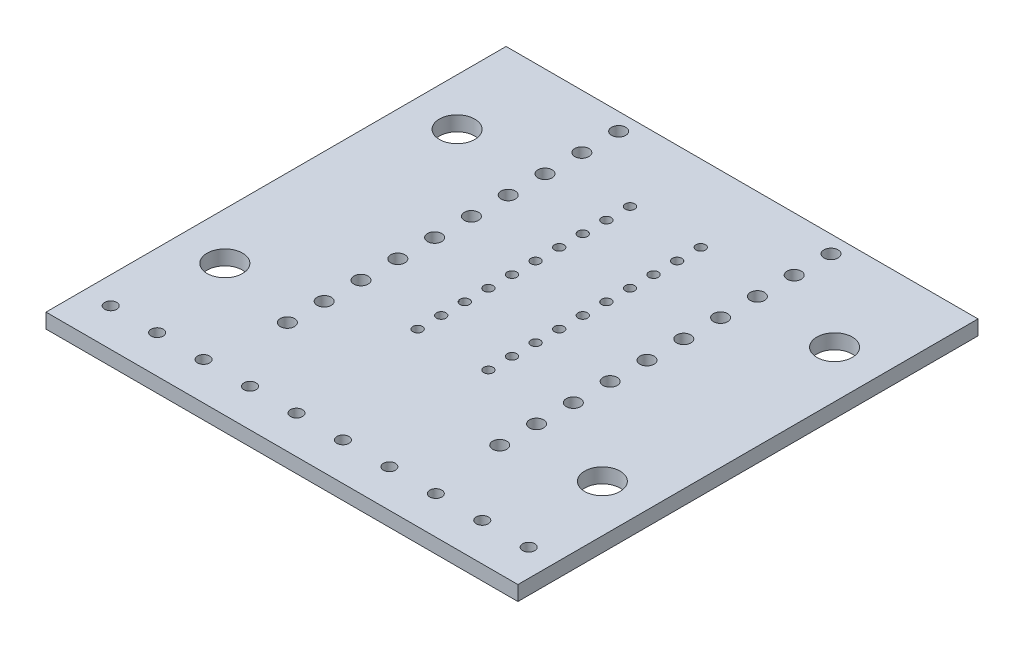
ISO-10303-21;
HEADER;
FILE_DESCRIPTION(('STEP AP214'),'2;1');
FILE_NAME('part.step','',(''),(''),'','','');
FILE_SCHEMA(('AUTOMOTIVE_DESIGN { 1 0 10303 214 1 1 1 1 }'));
ENDSEC;
DATA;
#1=APPLICATION_CONTEXT('core data for automotive mechanical design processes');
#2=APPLICATION_PROTOCOL_DEFINITION('international standard','automotive_design',2000,#1);
#3=PRODUCT_CONTEXT('',#1,'mechanical');
#4=PRODUCT('Part','Part','',(#3));
#5=PRODUCT_RELATED_PRODUCT_CATEGORY('part','',(#4));
#6=PRODUCT_DEFINITION_FORMATION('','',#4);
#7=PRODUCT_DEFINITION_CONTEXT('part definition',#1,'design');
#8=PRODUCT_DEFINITION('design','',#6,#7);
#9=PRODUCT_DEFINITION_SHAPE('','',#8);
#10=(LENGTH_UNIT() NAMED_UNIT(*) SI_UNIT(.MILLI.,.METRE.));
#11=(NAMED_UNIT(*) PLANE_ANGLE_UNIT() SI_UNIT($,.RADIAN.));
#12=(NAMED_UNIT(*) SI_UNIT($,.STERADIAN.) SOLID_ANGLE_UNIT());
#13=UNCERTAINTY_MEASURE_WITH_UNIT(LENGTH_MEASURE(1.E-05),#10,'distance_accuracy_value','');
#14=(GEOMETRIC_REPRESENTATION_CONTEXT(3) GLOBAL_UNCERTAINTY_ASSIGNED_CONTEXT((#13)) GLOBAL_UNIT_ASSIGNED_CONTEXT((#10,
#11,#12)) REPRESENTATION_CONTEXT('',''));
#15=CARTESIAN_POINT('',(0.,0.,0.));
#16=DIRECTION('',(0.,0.,1.));
#17=DIRECTION('',(1.,0.,0.));
#18=AXIS2_PLACEMENT_3D('',#15,#16,#17);
#19=CARTESIAN_POINT('',(0.,1.5875,0.));
#20=DIRECTION('',(0.,1.,0.));
#21=DIRECTION('',(0.,0.,1.));
#22=AXIS2_PLACEMENT_3D('',#19,#20,#21);
#23=PLANE('',#22);
#24=CARTESIAN_POINT('',(17.5006,1.5875,-4.06400000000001));
#25=DIRECTION('',(0.,1.,0.));
#26=DIRECTION('',(0.,0.,-1.));
#27=AXIS2_PLACEMENT_3D('',#24,#25,#26);
#28=CIRCLE('',#27,0.650000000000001);
#29=CARTESIAN_POINT('',(17.5006,1.5875,-4.71400000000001));
#30=VERTEX_POINT('',#29);
#31=EDGE_CURVE('E421',#30,#30,#28,.T.);
#32=ORIENTED_EDGE('',*,*,#31,.F.);
#33=EDGE_LOOP('',(#32));
#34=FACE_BOUND('',#33,.T.);
#35=CARTESIAN_POINT('',(7.50062,1.5875,-4.064));
#36=DIRECTION('',(0.,1.,0.));
#37=DIRECTION('',(0.,0.,-1.));
#38=AXIS2_PLACEMENT_3D('',#35,#36,#37);
#39=CIRCLE('',#38,0.65);
#40=CARTESIAN_POINT('',(7.50062,1.5875,-4.714));
#41=VERTEX_POINT('',#40);
#42=EDGE_CURVE('E409',#41,#41,#39,.T.);
#43=ORIENTED_EDGE('',*,*,#42,.F.);
#44=EDGE_LOOP('',(#43));
#45=FACE_BOUND('',#44,.T.);
#46=CARTESIAN_POINT('',(20.32,1.5875,-14.1732));
#47=DIRECTION('',(0.,1.,0.));
#48=DIRECTION('',(0.,0.,-1.));
#49=AXIS2_PLACEMENT_3D('',#46,#47,#48);
#50=CIRCLE('',#49,1.905);
#51=CARTESIAN_POINT('',(20.32,1.5875,-16.0782));
#52=VERTEX_POINT('',#51);
#53=EDGE_CURVE('E397',#52,#52,#50,.T.);
#54=ORIENTED_EDGE('',*,*,#53,.F.);
#55=EDGE_LOOP('',(#54));
#56=FACE_BOUND('',#55,.T.);
#57=CARTESIAN_POINT('',(11.43,1.5875,-12.0142));
#58=DIRECTION('',(0.,1.,0.));
#59=DIRECTION('',(0.,0.,-1.));
#60=AXIS2_PLACEMENT_3D('',#57,#58,#59);
#61=CIRCLE('',#60,0.762000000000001);
#62=CARTESIAN_POINT('',(11.43,1.5875,-12.7762));
#63=VERTEX_POINT('',#62);
#64=EDGE_CURVE('E385',#63,#63,#61,.T.);
#65=ORIENTED_EDGE('',*,*,#64,.F.);
#66=EDGE_LOOP('',(#65));
#67=FACE_BOUND('',#66,.T.);
#68=CARTESIAN_POINT('',(11.43,1.5875,-19.939));
#69=DIRECTION('',(0.,1.,0.));
#70=DIRECTION('',(0.,0.,-1.));
#71=AXIS2_PLACEMENT_3D('',#68,#69,#70);
#72=CIRCLE('',#71,0.762000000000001);
#73=CARTESIAN_POINT('',(11.43,1.5875,-20.701));
#74=VERTEX_POINT('',#73);
#75=EDGE_CURVE('E373',#74,#74,#72,.T.);
#76=ORIENTED_EDGE('',*,*,#75,.F.);
#77=EDGE_LOOP('',(#76));
#78=FACE_BOUND('',#77,.T.);
#79=CARTESIAN_POINT('',(11.43,1.5875,-27.8638));
#80=DIRECTION('',(0.,1.,0.));
#81=DIRECTION('',(0.,0.,-1.));
#82=AXIS2_PLACEMENT_3D('',#79,#80,#81);
#83=CIRCLE('',#82,0.762000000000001);
#84=CARTESIAN_POINT('',(11.43,1.5875,-28.6258));
#85=VERTEX_POINT('',#84);
#86=EDGE_CURVE('E361',#85,#85,#83,.T.);
#87=ORIENTED_EDGE('',*,*,#86,.F.);
#88=EDGE_LOOP('',(#87));
#89=FACE_BOUND('',#88,.T.);
#90=CARTESIAN_POINT('',(11.43,1.5875,-35.7886));
#91=DIRECTION('',(0.,1.,0.));
#92=DIRECTION('',(0.,0.,-1.));
#93=AXIS2_PLACEMENT_3D('',#90,#91,#92);
#94=CIRCLE('',#93,0.762000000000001);
#95=CARTESIAN_POINT('',(11.43,1.5875,-36.5506));
#96=VERTEX_POINT('',#95);
#97=EDGE_CURVE('E349',#96,#96,#94,.T.);
#98=ORIENTED_EDGE('',*,*,#97,.F.);
#99=EDGE_LOOP('',(#98));
#100=FACE_BOUND('',#99,.T.);
#101=CARTESIAN_POINT('',(11.43,1.5875,-43.7134));
#102=DIRECTION('',(0.,1.,0.));
#103=DIRECTION('',(0.,0.,-1.));
#104=AXIS2_PLACEMENT_3D('',#101,#102,#103);
#105=CIRCLE('',#104,0.762000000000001);
#106=CARTESIAN_POINT('',(11.43,1.5875,-44.4754));
#107=VERTEX_POINT('',#106);
#108=EDGE_CURVE('E337',#107,#107,#105,.T.);
#109=ORIENTED_EDGE('',*,*,#108,.F.);
#110=EDGE_LOOP('',(#109));
#111=FACE_BOUND('',#110,.T.);
#112=CARTESIAN_POINT('',(-3.81000000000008,1.5875,-41.275));
#113=DIRECTION('',(0.,1.,0.));
#114=DIRECTION('',(0.,0.,1.));
#115=AXIS2_PLACEMENT_3D('',#112,#113,#114);
#116=CIRCLE('',#115,0.507999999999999);
#117=CARTESIAN_POINT('',(-3.81000000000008,1.5875,-40.767));
#118=VERTEX_POINT('',#117);
#119=EDGE_CURVE('E325',#118,#118,#116,.T.);
#120=ORIENTED_EDGE('',*,*,#119,.F.);
#121=EDGE_LOOP('',(#120));
#122=FACE_BOUND('',#121,.T.);
#123=CARTESIAN_POINT('',(-3.81000000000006,1.5875,-36.195));
#124=DIRECTION('',(0.,1.,0.));
#125=DIRECTION('',(0.,0.,1.));
#126=AXIS2_PLACEMENT_3D('',#123,#124,#125);
#127=CIRCLE('',#126,0.507999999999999);
#128=CARTESIAN_POINT('',(-3.81000000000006,1.5875,-35.687));
#129=VERTEX_POINT('',#128);
#130=EDGE_CURVE('E313',#129,#129,#127,.T.);
#131=ORIENTED_EDGE('',*,*,#130,.F.);
#132=EDGE_LOOP('',(#131));
#133=FACE_BOUND('',#132,.T.);
#134=CARTESIAN_POINT('',(-3.81000000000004,1.5875,-31.115));
#135=DIRECTION('',(0.,1.,0.));
#136=DIRECTION('',(0.,0.,1.));
#137=AXIS2_PLACEMENT_3D('',#134,#135,#136);
#138=CIRCLE('',#137,0.508000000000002);
#139=CARTESIAN_POINT('',(-3.81000000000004,1.5875,-30.607));
#140=VERTEX_POINT('',#139);
#141=EDGE_CURVE('E301',#140,#140,#138,.T.);
#142=ORIENTED_EDGE('',*,*,#141,.F.);
#143=EDGE_LOOP('',(#142));
#144=FACE_BOUND('',#143,.T.);
#145=CARTESIAN_POINT('',(-3.81000000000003,1.5875,-26.035));
#146=DIRECTION('',(0.,1.,0.));
#147=DIRECTION('',(0.,0.,1.));
#148=AXIS2_PLACEMENT_3D('',#145,#146,#147);
#149=CIRCLE('',#148,0.508000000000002);
#150=CARTESIAN_POINT('',(-3.81000000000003,1.5875,-25.527));
#151=VERTEX_POINT('',#150);
#152=EDGE_CURVE('E289',#151,#151,#149,.T.);
#153=ORIENTED_EDGE('',*,*,#152,.F.);
#154=EDGE_LOOP('',(#153));
#155=FACE_BOUND('',#154,.T.);
#156=CARTESIAN_POINT('',(-3.81000000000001,1.5875,-20.955));
#157=DIRECTION('',(0.,1.,0.));
#158=DIRECTION('',(0.,0.,1.));
#159=AXIS2_PLACEMENT_3D('',#156,#157,#158);
#160=CIRCLE('',#159,0.508);
#161=CARTESIAN_POINT('',(-3.81000000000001,1.5875,-20.447));
#162=VERTEX_POINT('',#161);
#163=EDGE_CURVE('E277',#162,#162,#160,.T.);
#164=ORIENTED_EDGE('',*,*,#163,.F.);
#165=EDGE_LOOP('',(#164));
#166=FACE_BOUND('',#165,.T.);
#167=CARTESIAN_POINT('',(3.81,1.5875,-20.955));
#168=DIRECTION('',(0.,1.,0.));
#169=DIRECTION('',(0.,0.,-1.));
#170=AXIS2_PLACEMENT_3D('',#167,#168,#169);
#171=CIRCLE('',#170,0.508);
#172=CARTESIAN_POINT('',(3.81,1.5875,-21.463));
#173=VERTEX_POINT('',#172);
#174=EDGE_CURVE('E265',#173,#173,#171,.T.);
#175=ORIENTED_EDGE('',*,*,#174,.F.);
#176=EDGE_LOOP('',(#175));
#177=FACE_BOUND('',#176,.T.);
#178=CARTESIAN_POINT('',(3.81000000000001,1.5875,-26.035));
#179=DIRECTION('',(0.,1.,0.));
#180=DIRECTION('',(0.,0.,-1.));
#181=AXIS2_PLACEMENT_3D('',#178,#179,#180);
#182=CIRCLE('',#181,0.508000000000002);
#183=CARTESIAN_POINT('',(3.81000000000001,1.5875,-26.543));
#184=VERTEX_POINT('',#183);
#185=EDGE_CURVE('E253',#184,#184,#182,.T.);
#186=ORIENTED_EDGE('',*,*,#185,.F.);
#187=EDGE_LOOP('',(#186));
#188=FACE_BOUND('',#187,.T.);
#189=CARTESIAN_POINT('',(3.81000000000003,1.5875,-31.115));
#190=DIRECTION('',(0.,1.,0.));
#191=DIRECTION('',(0.,0.,-1.));
#192=AXIS2_PLACEMENT_3D('',#189,#190,#191);
#193=CIRCLE('',#192,0.508000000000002);
#194=CARTESIAN_POINT('',(3.81000000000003,1.5875,-31.623));
#195=VERTEX_POINT('',#194);
#196=EDGE_CURVE('E241',#195,#195,#193,.T.);
#197=ORIENTED_EDGE('',*,*,#196,.F.);
#198=EDGE_LOOP('',(#197));
#199=FACE_BOUND('',#198,.T.);
#200=CARTESIAN_POINT('',(3.81000000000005,1.5875,-36.195));
#201=DIRECTION('',(0.,1.,0.));
#202=DIRECTION('',(0.,0.,-1.));
#203=AXIS2_PLACEMENT_3D('',#200,#201,#202);
#204=CIRCLE('',#203,0.507999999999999);
#205=CARTESIAN_POINT('',(3.81000000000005,1.5875,-36.703));
#206=VERTEX_POINT('',#205);
#207=EDGE_CURVE('E229',#206,#206,#204,.T.);
#208=ORIENTED_EDGE('',*,*,#207,.F.);
#209=EDGE_LOOP('',(#208));
#210=FACE_BOUND('',#209,.T.);
#211=CARTESIAN_POINT('',(3.81000000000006,1.5875,-41.275));
#212=DIRECTION('',(0.,1.,0.));
#213=DIRECTION('',(0.,0.,-1.));
#214=AXIS2_PLACEMENT_3D('',#211,#212,#213);
#215=CIRCLE('',#214,0.507999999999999);
#216=CARTESIAN_POINT('',(3.81000000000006,1.5875,-41.783));
#217=VERTEX_POINT('',#216);
#218=EDGE_CURVE('E217',#217,#217,#215,.T.);
#219=ORIENTED_EDGE('',*,*,#218,.F.);
#220=EDGE_LOOP('',(#219));
#221=FACE_BOUND('',#220,.T.);
#222=CARTESIAN_POINT('',(-11.43,1.5875,-47.6758));
#223=DIRECTION('',(0.,1.,0.));
#224=DIRECTION('',(0.,0.,1.));
#225=AXIS2_PLACEMENT_3D('',#222,#223,#224);
#226=CIRCLE('',#225,0.762000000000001);
#227=CARTESIAN_POINT('',(-11.43,1.5875,-46.9138));
#228=VERTEX_POINT('',#227);
#229=EDGE_CURVE('E205',#228,#228,#226,.T.);
#230=ORIENTED_EDGE('',*,*,#229,.F.);
#231=EDGE_LOOP('',(#230));
#232=FACE_BOUND('',#231,.T.);
#233=CARTESIAN_POINT('',(-11.43,1.5875,-39.751));
#234=DIRECTION('',(0.,1.,0.));
#235=DIRECTION('',(0.,0.,1.));
#236=AXIS2_PLACEMENT_3D('',#233,#234,#235);
#237=CIRCLE('',#236,0.762000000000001);
#238=CARTESIAN_POINT('',(-11.43,1.5875,-38.989));
#239=VERTEX_POINT('',#238);
#240=EDGE_CURVE('E193',#239,#239,#237,.T.);
#241=ORIENTED_EDGE('',*,*,#240,.F.);
#242=EDGE_LOOP('',(#241));
#243=FACE_BOUND('',#242,.T.);
#244=CARTESIAN_POINT('',(-11.43,1.5875,-31.8262));
#245=DIRECTION('',(0.,1.,0.));
#246=DIRECTION('',(0.,0.,1.));
#247=AXIS2_PLACEMENT_3D('',#244,#245,#246);
#248=CIRCLE('',#247,0.762000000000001);
#249=CARTESIAN_POINT('',(-11.43,1.5875,-31.0642));
#250=VERTEX_POINT('',#249);
#251=EDGE_CURVE('E181',#250,#250,#248,.T.);
#252=ORIENTED_EDGE('',*,*,#251,.F.);
#253=EDGE_LOOP('',(#252));
#254=FACE_BOUND('',#253,.T.);
#255=CARTESIAN_POINT('',(-11.43,1.5875,-23.9014));
#256=DIRECTION('',(0.,1.,0.));
#257=DIRECTION('',(0.,0.,1.));
#258=AXIS2_PLACEMENT_3D('',#255,#256,#257);
#259=CIRCLE('',#258,0.762000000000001);
#260=CARTESIAN_POINT('',(-11.43,1.5875,-23.1394));
#261=VERTEX_POINT('',#260);
#262=EDGE_CURVE('E169',#261,#261,#259,.T.);
#263=ORIENTED_EDGE('',*,*,#262,.F.);
#264=EDGE_LOOP('',(#263));
#265=FACE_BOUND('',#264,.T.);
#266=CARTESIAN_POINT('',(-11.43,1.5875,-15.9766));
#267=DIRECTION('',(0.,1.,0.));
#268=DIRECTION('',(0.,0.,1.));
#269=AXIS2_PLACEMENT_3D('',#266,#267,#268);
#270=CIRCLE('',#269,0.762000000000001);
#271=CARTESIAN_POINT('',(-11.43,1.5875,-15.2146));
#272=VERTEX_POINT('',#271);
#273=EDGE_CURVE('E157',#272,#272,#270,.T.);
#274=ORIENTED_EDGE('',*,*,#273,.F.);
#275=EDGE_LOOP('',(#274));
#276=FACE_BOUND('',#275,.T.);
#277=CARTESIAN_POINT('',(-20.32,1.5875,-39.16934));
#278=DIRECTION('',(0.,1.,0.));
#279=DIRECTION('',(0.,0.,1.));
#280=AXIS2_PLACEMENT_3D('',#277,#278,#279);
#281=CIRCLE('',#280,1.905);
#282=CARTESIAN_POINT('',(-20.32,1.5875,-37.26434));
#283=VERTEX_POINT('',#282);
#284=EDGE_CURVE('E145',#283,#283,#281,.T.);
#285=ORIENTED_EDGE('',*,*,#284,.F.);
#286=EDGE_LOOP('',(#285));
#287=FACE_BOUND('',#286,.T.);
#288=CARTESIAN_POINT('',(-2.49936,1.5875,-4.064));
#289=DIRECTION('',(0.,1.,0.));
#290=DIRECTION('',(0.,0.,1.));
#291=AXIS2_PLACEMENT_3D('',#288,#289,#290);
#292=CIRCLE('',#291,0.65);
#293=CARTESIAN_POINT('',(-2.49936,1.5875,-3.414));
#294=VERTEX_POINT('',#293);
#295=EDGE_CURVE('E133',#294,#294,#292,.T.);
#296=ORIENTED_EDGE('',*,*,#295,.F.);
#297=EDGE_LOOP('',(#296));
#298=FACE_BOUND('',#297,.T.);
#299=CARTESIAN_POINT('',(-12.49934,1.5875,-4.064));
#300=DIRECTION('',(0.,1.,0.));
#301=DIRECTION('',(0.,0.,1.));
#302=AXIS2_PLACEMENT_3D('',#299,#300,#301);
#303=CIRCLE('',#302,0.649999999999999);
#304=CARTESIAN_POINT('',(-12.49934,1.5875,-3.414));
#305=VERTEX_POINT('',#304);
#306=EDGE_CURVE('E121',#305,#305,#303,.T.);
#307=ORIENTED_EDGE('',*,*,#306,.F.);
#308=EDGE_LOOP('',(#307));
#309=FACE_BOUND('',#308,.T.);
#310=CARTESIAN_POINT('',(-22.49932,1.5875,-4.064));
#311=DIRECTION('',(0.,1.,0.));
#312=DIRECTION('',(0.,0.,1.));
#313=AXIS2_PLACEMENT_3D('',#310,#311,#312);
#314=CIRCLE('',#313,0.650000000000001);
#315=CARTESIAN_POINT('',(-22.49932,1.5875,-3.414));
#316=VERTEX_POINT('',#315);
#317=EDGE_CURVE('E100',#316,#316,#314,.T.);
#318=ORIENTED_EDGE('',*,*,#317,.F.);
#319=EDGE_LOOP('',(#318));
#320=FACE_BOUND('',#319,.T.);
#321=DIRECTION('',(0.,0.,1.));
#322=VECTOR('',#321,1.);
#323=CARTESIAN_POINT('',(-25.4,1.5875,-49.53));
#324=LINE('',#323,#322);
#325=CARTESIAN_POINT('',(-25.4,1.5875,-49.53));
#326=VERTEX_POINT('',#325);
#327=CARTESIAN_POINT('',(-25.4,1.5875,0.));
#328=VERTEX_POINT('',#327);
#329=EDGE_CURVE('E85',#326,#328,#324,.T.);
#330=ORIENTED_EDGE('',*,*,#329,.T.);
#331=DIRECTION('',(1.,0.,0.));
#332=VECTOR('',#331,1.);
#333=CARTESIAN_POINT('',(-25.4,1.5875,0.));
#334=LINE('',#333,#332);
#335=CARTESIAN_POINT('',(25.4,1.5875,0.));
#336=VERTEX_POINT('',#335);
#337=EDGE_CURVE('E80',#328,#336,#334,.T.);
#338=ORIENTED_EDGE('',*,*,#337,.T.);
#339=DIRECTION('',(0.,0.,-1.));
#340=VECTOR('',#339,1.);
#341=CARTESIAN_POINT('',(25.4,1.5875,-49.53));
#342=LINE('',#341,#340);
#343=CARTESIAN_POINT('',(25.4,1.5875,-49.53));
#344=VERTEX_POINT('',#343);
#345=EDGE_CURVE('E83',#336,#344,#342,.T.);
#346=ORIENTED_EDGE('',*,*,#345,.T.);
#347=DIRECTION('',(-1.,0.,0.));
#348=VECTOR('',#347,1.);
#349=CARTESIAN_POINT('',(-25.4,1.5875,-49.53));
#350=LINE('',#349,#348);
#351=EDGE_CURVE('E50',#344,#326,#350,.T.);
#352=ORIENTED_EDGE('',*,*,#351,.T.);
#353=EDGE_LOOP('',(#330,#338,#346,#352));
#354=FACE_BOUND('',#353,.T.);
#355=CARTESIAN_POINT('',(-17.5006,1.5875,-4.064));
#356=DIRECTION('',(0.,1.,0.));
#357=DIRECTION('',(0.,0.,1.));
#358=AXIS2_PLACEMENT_3D('',#355,#356,#357);
#359=CIRCLE('',#358,0.650000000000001);
#360=CARTESIAN_POINT('',(-17.5006,1.5875,-3.414));
#361=VERTEX_POINT('',#360);
#362=EDGE_CURVE('E115',#361,#361,#359,.T.);
#363=ORIENTED_EDGE('',*,*,#362,.F.);
#364=EDGE_LOOP('',(#363));
#365=FACE_BOUND('',#364,.T.);
#366=CARTESIAN_POINT('',(-7.50062,1.5875,-4.064));
#367=DIRECTION('',(0.,1.,0.));
#368=DIRECTION('',(0.,0.,1.));
#369=AXIS2_PLACEMENT_3D('',#366,#367,#368);
#370=CIRCLE('',#369,0.65);
#371=CARTESIAN_POINT('',(-7.50062,1.5875,-3.414));
#372=VERTEX_POINT('',#371);
#373=EDGE_CURVE('E127',#372,#372,#370,.T.);
#374=ORIENTED_EDGE('',*,*,#373,.F.);
#375=EDGE_LOOP('',(#374));
#376=FACE_BOUND('',#375,.T.);
#377=CARTESIAN_POINT('',(-20.32,1.5875,-14.1732));
#378=DIRECTION('',(0.,1.,0.));
#379=DIRECTION('',(0.,0.,1.));
#380=AXIS2_PLACEMENT_3D('',#377,#378,#379);
#381=CIRCLE('',#380,1.905);
#382=CARTESIAN_POINT('',(-20.32,1.5875,-12.2682));
#383=VERTEX_POINT('',#382);
#384=EDGE_CURVE('E139',#383,#383,#381,.T.);
#385=ORIENTED_EDGE('',*,*,#384,.F.);
#386=EDGE_LOOP('',(#385));
#387=FACE_BOUND('',#386,.T.);
#388=CARTESIAN_POINT('',(-11.43,1.5875,-12.0142));
#389=DIRECTION('',(0.,1.,0.));
#390=DIRECTION('',(0.,0.,1.));
#391=AXIS2_PLACEMENT_3D('',#388,#389,#390);
#392=CIRCLE('',#391,0.762000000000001);
#393=CARTESIAN_POINT('',(-11.43,1.5875,-11.2522));
#394=VERTEX_POINT('',#393);
#395=EDGE_CURVE('E151',#394,#394,#392,.T.);
#396=ORIENTED_EDGE('',*,*,#395,.F.);
#397=EDGE_LOOP('',(#396));
#398=FACE_BOUND('',#397,.T.);
#399=CARTESIAN_POINT('',(-11.43,1.5875,-19.939));
#400=DIRECTION('',(0.,1.,0.));
#401=DIRECTION('',(0.,0.,1.));
#402=AXIS2_PLACEMENT_3D('',#399,#400,#401);
#403=CIRCLE('',#402,0.762000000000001);
#404=CARTESIAN_POINT('',(-11.43,1.5875,-19.177));
#405=VERTEX_POINT('',#404);
#406=EDGE_CURVE('E163',#405,#405,#403,.T.);
#407=ORIENTED_EDGE('',*,*,#406,.F.);
#408=EDGE_LOOP('',(#407));
#409=FACE_BOUND('',#408,.T.);
#410=CARTESIAN_POINT('',(-11.43,1.5875,-27.8638));
#411=DIRECTION('',(0.,1.,0.));
#412=DIRECTION('',(0.,0.,1.));
#413=AXIS2_PLACEMENT_3D('',#410,#411,#412);
#414=CIRCLE('',#413,0.762000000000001);
#415=CARTESIAN_POINT('',(-11.43,1.5875,-27.1018));
#416=VERTEX_POINT('',#415);
#417=EDGE_CURVE('E175',#416,#416,#414,.T.);
#418=ORIENTED_EDGE('',*,*,#417,.F.);
#419=EDGE_LOOP('',(#418));
#420=FACE_BOUND('',#419,.T.);
#421=CARTESIAN_POINT('',(-11.43,1.5875,-35.7886));
#422=DIRECTION('',(0.,1.,0.));
#423=DIRECTION('',(0.,0.,1.));
#424=AXIS2_PLACEMENT_3D('',#421,#422,#423);
#425=CIRCLE('',#424,0.762000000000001);
#426=CARTESIAN_POINT('',(-11.43,1.5875,-35.0266));
#427=VERTEX_POINT('',#426);
#428=EDGE_CURVE('E187',#427,#427,#425,.T.);
#429=ORIENTED_EDGE('',*,*,#428,.F.);
#430=EDGE_LOOP('',(#429));
#431=FACE_BOUND('',#430,.T.);
#432=CARTESIAN_POINT('',(-11.43,1.5875,-43.7134));
#433=DIRECTION('',(0.,1.,0.));
#434=DIRECTION('',(0.,0.,1.));
#435=AXIS2_PLACEMENT_3D('',#432,#433,#434);
#436=CIRCLE('',#435,0.762000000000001);
#437=CARTESIAN_POINT('',(-11.43,1.5875,-42.9514));
#438=VERTEX_POINT('',#437);
#439=EDGE_CURVE('E199',#438,#438,#436,.T.);
#440=ORIENTED_EDGE('',*,*,#439,.F.);
#441=EDGE_LOOP('',(#440));
#442=FACE_BOUND('',#441,.T.);
#443=CARTESIAN_POINT('',(-3.81,1.5875,-18.415));
#444=DIRECTION('',(0.,1.,0.));
#445=DIRECTION('',(0.,0.,1.));
#446=AXIS2_PLACEMENT_3D('',#443,#444,#445);
#447=CIRCLE('',#446,0.508);
#448=CARTESIAN_POINT('',(-3.81,1.5875,-17.907));
#449=VERTEX_POINT('',#448);
#450=EDGE_CURVE('E211',#449,#449,#447,.T.);
#451=ORIENTED_EDGE('',*,*,#450,.F.);
#452=EDGE_LOOP('',(#451));
#453=FACE_BOUND('',#452,.T.);
#454=CARTESIAN_POINT('',(3.81000000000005,1.5875,-38.735));
#455=DIRECTION('',(0.,1.,0.));
#456=DIRECTION('',(0.,0.,-1.));
#457=AXIS2_PLACEMENT_3D('',#454,#455,#456);
#458=CIRCLE('',#457,0.507999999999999);
#459=CARTESIAN_POINT('',(3.81000000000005,1.5875,-39.243));
#460=VERTEX_POINT('',#459);
#461=EDGE_CURVE('E223',#460,#460,#458,.T.);
#462=ORIENTED_EDGE('',*,*,#461,.F.);
#463=EDGE_LOOP('',(#462));
#464=FACE_BOUND('',#463,.T.);
#465=CARTESIAN_POINT('',(3.81000000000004,1.5875,-33.655));
#466=DIRECTION('',(0.,1.,0.));
#467=DIRECTION('',(0.,0.,-1.));
#468=AXIS2_PLACEMENT_3D('',#465,#466,#467);
#469=CIRCLE('',#468,0.507999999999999);
#470=CARTESIAN_POINT('',(3.81000000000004,1.5875,-34.163));
#471=VERTEX_POINT('',#470);
#472=EDGE_CURVE('E235',#471,#471,#469,.T.);
#473=ORIENTED_EDGE('',*,*,#472,.F.);
#474=EDGE_LOOP('',(#473));
#475=FACE_BOUND('',#474,.T.);
#476=CARTESIAN_POINT('',(3.81000000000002,1.5875,-28.575));
#477=DIRECTION('',(0.,1.,0.));
#478=DIRECTION('',(0.,0.,-1.));
#479=AXIS2_PLACEMENT_3D('',#476,#477,#478);
#480=CIRCLE('',#479,0.508000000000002);
#481=CARTESIAN_POINT('',(3.81000000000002,1.5875,-29.083));
#482=VERTEX_POINT('',#481);
#483=EDGE_CURVE('E247',#482,#482,#480,.T.);
#484=ORIENTED_EDGE('',*,*,#483,.F.);
#485=EDGE_LOOP('',(#484));
#486=FACE_BOUND('',#485,.T.);
#487=CARTESIAN_POINT('',(3.81000000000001,1.5875,-23.495));
#488=DIRECTION('',(0.,1.,0.));
#489=DIRECTION('',(0.,0.,-1.));
#490=AXIS2_PLACEMENT_3D('',#487,#488,#489);
#491=CIRCLE('',#490,0.508);
#492=CARTESIAN_POINT('',(3.81000000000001,1.5875,-24.003));
#493=VERTEX_POINT('',#492);
#494=EDGE_CURVE('E259',#493,#493,#491,.T.);
#495=ORIENTED_EDGE('',*,*,#494,.F.);
#496=EDGE_LOOP('',(#495));
#497=FACE_BOUND('',#496,.T.);
#498=CARTESIAN_POINT('',(3.80999999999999,1.5875,-18.415));
#499=DIRECTION('',(0.,1.,0.));
#500=DIRECTION('',(0.,0.,-1.));
#501=AXIS2_PLACEMENT_3D('',#498,#499,#500);
#502=CIRCLE('',#501,0.508);
#503=CARTESIAN_POINT('',(3.80999999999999,1.5875,-18.923));
#504=VERTEX_POINT('',#503);
#505=EDGE_CURVE('E271',#504,#504,#502,.T.);
#506=ORIENTED_EDGE('',*,*,#505,.F.);
#507=EDGE_LOOP('',(#506));
#508=FACE_BOUND('',#507,.T.);
#509=CARTESIAN_POINT('',(-3.81000000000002,1.5875,-23.495));
#510=DIRECTION('',(0.,1.,0.));
#511=DIRECTION('',(0.,0.,1.));
#512=AXIS2_PLACEMENT_3D('',#509,#510,#511);
#513=CIRCLE('',#512,0.508);
#514=CARTESIAN_POINT('',(-3.81000000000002,1.5875,-22.987));
#515=VERTEX_POINT('',#514);
#516=EDGE_CURVE('E283',#515,#515,#513,.T.);
#517=ORIENTED_EDGE('',*,*,#516,.F.);
#518=EDGE_LOOP('',(#517));
#519=FACE_BOUND('',#518,.T.);
#520=CARTESIAN_POINT('',(-3.81000000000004,1.5875,-28.575));
#521=DIRECTION('',(0.,1.,0.));
#522=DIRECTION('',(0.,0.,1.));
#523=AXIS2_PLACEMENT_3D('',#520,#521,#522);
#524=CIRCLE('',#523,0.508000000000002);
#525=CARTESIAN_POINT('',(-3.81000000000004,1.5875,-28.067));
#526=VERTEX_POINT('',#525);
#527=EDGE_CURVE('E295',#526,#526,#524,.T.);
#528=ORIENTED_EDGE('',*,*,#527,.F.);
#529=EDGE_LOOP('',(#528));
#530=FACE_BOUND('',#529,.T.);
#531=CARTESIAN_POINT('',(-3.81000000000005,1.5875,-33.655));
#532=DIRECTION('',(0.,1.,0.));
#533=DIRECTION('',(0.,0.,1.));
#534=AXIS2_PLACEMENT_3D('',#531,#532,#533);
#535=CIRCLE('',#534,0.507999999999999);
#536=CARTESIAN_POINT('',(-3.81000000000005,1.5875,-33.147));
#537=VERTEX_POINT('',#536);
#538=EDGE_CURVE('E307',#537,#537,#535,.T.);
#539=ORIENTED_EDGE('',*,*,#538,.F.);
#540=EDGE_LOOP('',(#539));
#541=FACE_BOUND('',#540,.T.);
#542=CARTESIAN_POINT('',(-3.81000000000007,1.5875,-38.735));
#543=DIRECTION('',(0.,1.,0.));
#544=DIRECTION('',(0.,0.,1.));
#545=AXIS2_PLACEMENT_3D('',#542,#543,#544);
#546=CIRCLE('',#545,0.507999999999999);
#547=CARTESIAN_POINT('',(-3.81000000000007,1.5875,-38.227));
#548=VERTEX_POINT('',#547);
#549=EDGE_CURVE('E319',#548,#548,#546,.T.);
#550=ORIENTED_EDGE('',*,*,#549,.F.);
#551=EDGE_LOOP('',(#550));
#552=FACE_BOUND('',#551,.T.);
#553=CARTESIAN_POINT('',(11.43,1.5875,-47.6758));
#554=DIRECTION('',(0.,1.,0.));
#555=DIRECTION('',(0.,0.,-1.));
#556=AXIS2_PLACEMENT_3D('',#553,#554,#555);
#557=CIRCLE('',#556,0.762000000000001);
#558=CARTESIAN_POINT('',(11.43,1.5875,-48.4378));
#559=VERTEX_POINT('',#558);
#560=EDGE_CURVE('E331',#559,#559,#557,.T.);
#561=ORIENTED_EDGE('',*,*,#560,.F.);
#562=EDGE_LOOP('',(#561));
#563=FACE_BOUND('',#562,.T.);
#564=CARTESIAN_POINT('',(11.43,1.5875,-39.751));
#565=DIRECTION('',(0.,1.,0.));
#566=DIRECTION('',(0.,0.,-1.));
#567=AXIS2_PLACEMENT_3D('',#564,#565,#566);
#568=CIRCLE('',#567,0.762000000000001);
#569=CARTESIAN_POINT('',(11.43,1.5875,-40.513));
#570=VERTEX_POINT('',#569);
#571=EDGE_CURVE('E343',#570,#570,#568,.T.);
#572=ORIENTED_EDGE('',*,*,#571,.F.);
#573=EDGE_LOOP('',(#572));
#574=FACE_BOUND('',#573,.T.);
#575=CARTESIAN_POINT('',(11.43,1.5875,-31.8262));
#576=DIRECTION('',(0.,1.,0.));
#577=DIRECTION('',(0.,0.,-1.));
#578=AXIS2_PLACEMENT_3D('',#575,#576,#577);
#579=CIRCLE('',#578,0.762000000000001);
#580=CARTESIAN_POINT('',(11.43,1.5875,-32.5882));
#581=VERTEX_POINT('',#580);
#582=EDGE_CURVE('E355',#581,#581,#579,.T.);
#583=ORIENTED_EDGE('',*,*,#582,.F.);
#584=EDGE_LOOP('',(#583));
#585=FACE_BOUND('',#584,.T.);
#586=CARTESIAN_POINT('',(11.43,1.5875,-23.9014));
#587=DIRECTION('',(0.,1.,0.));
#588=DIRECTION('',(0.,0.,-1.));
#589=AXIS2_PLACEMENT_3D('',#586,#587,#588);
#590=CIRCLE('',#589,0.762000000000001);
#591=CARTESIAN_POINT('',(11.43,1.5875,-24.6634));
#592=VERTEX_POINT('',#591);
#593=EDGE_CURVE('E367',#592,#592,#590,.T.);
#594=ORIENTED_EDGE('',*,*,#593,.F.);
#595=EDGE_LOOP('',(#594));
#596=FACE_BOUND('',#595,.T.);
#597=CARTESIAN_POINT('',(11.43,1.5875,-15.9766));
#598=DIRECTION('',(0.,1.,0.));
#599=DIRECTION('',(0.,0.,-1.));
#600=AXIS2_PLACEMENT_3D('',#597,#598,#599);
#601=CIRCLE('',#600,0.762000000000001);
#602=CARTESIAN_POINT('',(11.43,1.5875,-16.7386));
#603=VERTEX_POINT('',#602);
#604=EDGE_CURVE('E379',#603,#603,#601,.T.);
#605=ORIENTED_EDGE('',*,*,#604,.F.);
#606=EDGE_LOOP('',(#605));
#607=FACE_BOUND('',#606,.T.);
#608=CARTESIAN_POINT('',(20.32,1.5875,-39.16934));
#609=DIRECTION('',(0.,1.,0.));
#610=DIRECTION('',(0.,0.,-1.));
#611=AXIS2_PLACEMENT_3D('',#608,#609,#610);
#612=CIRCLE('',#611,1.905);
#613=CARTESIAN_POINT('',(20.32,1.5875,-41.07434));
#614=VERTEX_POINT('',#613);
#615=EDGE_CURVE('E391',#614,#614,#612,.T.);
#616=ORIENTED_EDGE('',*,*,#615,.F.);
#617=EDGE_LOOP('',(#616));
#618=FACE_BOUND('',#617,.T.);
#619=CARTESIAN_POINT('',(2.49936,1.5875,-4.064));
#620=DIRECTION('',(0.,1.,0.));
#621=DIRECTION('',(0.,0.,-1.));
#622=AXIS2_PLACEMENT_3D('',#619,#620,#621);
#623=CIRCLE('',#622,0.65);
#624=CARTESIAN_POINT('',(2.49936,1.5875,-4.714));
#625=VERTEX_POINT('',#624);
#626=EDGE_CURVE('E403',#625,#625,#623,.T.);
#627=ORIENTED_EDGE('',*,*,#626,.F.);
#628=EDGE_LOOP('',(#627));
#629=FACE_BOUND('',#628,.T.);
#630=CARTESIAN_POINT('',(12.49934,1.5875,-4.06400000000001));
#631=DIRECTION('',(0.,1.,0.));
#632=DIRECTION('',(0.,0.,-1.));
#633=AXIS2_PLACEMENT_3D('',#630,#631,#632);
#634=CIRCLE('',#633,0.650000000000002);
#635=CARTESIAN_POINT('',(12.49934,1.5875,-4.71400000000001));
#636=VERTEX_POINT('',#635);
#637=EDGE_CURVE('E415',#636,#636,#634,.T.);
#638=ORIENTED_EDGE('',*,*,#637,.F.);
#639=EDGE_LOOP('',(#638));
#640=FACE_BOUND('',#639,.T.);
#641=CARTESIAN_POINT('',(22.49932,1.5875,-4.06400000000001));
#642=DIRECTION('',(0.,1.,0.));
#643=DIRECTION('',(0.,0.,-1.));
#644=AXIS2_PLACEMENT_3D('',#641,#642,#643);
#645=CIRCLE('',#644,0.650000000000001);
#646=CARTESIAN_POINT('',(22.49932,1.5875,-4.71400000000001));
#647=VERTEX_POINT('',#646);
#648=EDGE_CURVE('E427',#647,#647,#645,.T.);
#649=ORIENTED_EDGE('',*,*,#648,.F.);
#650=EDGE_LOOP('',(#649));
#651=FACE_BOUND('',#650,.T.);
#652=ADVANCED_FACE('F33',(#34,#45,#56,#67,#78,#89,#100,#111,#122,#133,#144,#155,#166,#177,#188,
#199,#210,#221,#232,#243,#254,#265,#276,#287,#298,#309,#320,#354,#365,#376,#387,#398,#409,#420,
#431,#442,#453,#464,#475,#486,#497,#508,#519,#530,#541,#552,#563,#574,#585,#596,#607,#618,#629,
#640,#651),#23,.T.);
#653=CARTESIAN_POINT('',(0.,0.,0.));
#654=DIRECTION('',(0.,1.,0.));
#655=DIRECTION('',(0.,0.,1.));
#656=AXIS2_PLACEMENT_3D('',#653,#654,#655);
#657=PLANE('',#656);
#658=CARTESIAN_POINT('',(17.5006,0.,-4.06400000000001));
#659=DIRECTION('',(0.,1.,0.));
#660=DIRECTION('',(0.,0.,-1.));
#661=AXIS2_PLACEMENT_3D('',#658,#659,#660);
#662=CIRCLE('',#661,0.650000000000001);
#663=CARTESIAN_POINT('',(17.5006,0.,-4.71400000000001));
#664=VERTEX_POINT('',#663);
#665=EDGE_CURVE('E424',#664,#664,#662,.T.);
#666=ORIENTED_EDGE('',*,*,#665,.T.);
#667=EDGE_LOOP('',(#666));
#668=FACE_BOUND('',#667,.T.);
#669=CARTESIAN_POINT('',(7.50062,0.,-4.064));
#670=DIRECTION('',(0.,1.,0.));
#671=DIRECTION('',(0.,0.,-1.));
#672=AXIS2_PLACEMENT_3D('',#669,#670,#671);
#673=CIRCLE('',#672,0.65);
#674=CARTESIAN_POINT('',(7.50062,0.,-4.714));
#675=VERTEX_POINT('',#674);
#676=EDGE_CURVE('E412',#675,#675,#673,.T.);
#677=ORIENTED_EDGE('',*,*,#676,.T.);
#678=EDGE_LOOP('',(#677));
#679=FACE_BOUND('',#678,.T.);
#680=CARTESIAN_POINT('',(20.32,0.,-14.1732));
#681=DIRECTION('',(0.,1.,0.));
#682=DIRECTION('',(0.,0.,-1.));
#683=AXIS2_PLACEMENT_3D('',#680,#681,#682);
#684=CIRCLE('',#683,1.905);
#685=CARTESIAN_POINT('',(20.32,0.,-16.0782));
#686=VERTEX_POINT('',#685);
#687=EDGE_CURVE('E400',#686,#686,#684,.T.);
#688=ORIENTED_EDGE('',*,*,#687,.T.);
#689=EDGE_LOOP('',(#688));
#690=FACE_BOUND('',#689,.T.);
#691=CARTESIAN_POINT('',(11.43,0.,-12.0142));
#692=DIRECTION('',(0.,1.,0.));
#693=DIRECTION('',(0.,0.,-1.));
#694=AXIS2_PLACEMENT_3D('',#691,#692,#693);
#695=CIRCLE('',#694,0.762000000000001);
#696=CARTESIAN_POINT('',(11.43,0.,-12.7762));
#697=VERTEX_POINT('',#696);
#698=EDGE_CURVE('E388',#697,#697,#695,.T.);
#699=ORIENTED_EDGE('',*,*,#698,.T.);
#700=EDGE_LOOP('',(#699));
#701=FACE_BOUND('',#700,.T.);
#702=CARTESIAN_POINT('',(11.43,0.,-19.939));
#703=DIRECTION('',(0.,1.,0.));
#704=DIRECTION('',(0.,0.,-1.));
#705=AXIS2_PLACEMENT_3D('',#702,#703,#704);
#706=CIRCLE('',#705,0.762000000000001);
#707=CARTESIAN_POINT('',(11.43,0.,-20.701));
#708=VERTEX_POINT('',#707);
#709=EDGE_CURVE('E376',#708,#708,#706,.T.);
#710=ORIENTED_EDGE('',*,*,#709,.T.);
#711=EDGE_LOOP('',(#710));
#712=FACE_BOUND('',#711,.T.);
#713=CARTESIAN_POINT('',(11.43,0.,-27.8638));
#714=DIRECTION('',(0.,1.,0.));
#715=DIRECTION('',(0.,0.,-1.));
#716=AXIS2_PLACEMENT_3D('',#713,#714,#715);
#717=CIRCLE('',#716,0.762000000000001);
#718=CARTESIAN_POINT('',(11.43,0.,-28.6258));
#719=VERTEX_POINT('',#718);
#720=EDGE_CURVE('E364',#719,#719,#717,.T.);
#721=ORIENTED_EDGE('',*,*,#720,.T.);
#722=EDGE_LOOP('',(#721));
#723=FACE_BOUND('',#722,.T.);
#724=CARTESIAN_POINT('',(11.43,0.,-35.7886));
#725=DIRECTION('',(0.,1.,0.));
#726=DIRECTION('',(0.,0.,-1.));
#727=AXIS2_PLACEMENT_3D('',#724,#725,#726);
#728=CIRCLE('',#727,0.762000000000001);
#729=CARTESIAN_POINT('',(11.43,0.,-36.5506));
#730=VERTEX_POINT('',#729);
#731=EDGE_CURVE('E352',#730,#730,#728,.T.);
#732=ORIENTED_EDGE('',*,*,#731,.T.);
#733=EDGE_LOOP('',(#732));
#734=FACE_BOUND('',#733,.T.);
#735=CARTESIAN_POINT('',(11.43,0.,-43.7134));
#736=DIRECTION('',(0.,1.,0.));
#737=DIRECTION('',(0.,0.,-1.));
#738=AXIS2_PLACEMENT_3D('',#735,#736,#737);
#739=CIRCLE('',#738,0.762000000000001);
#740=CARTESIAN_POINT('',(11.43,0.,-44.4754));
#741=VERTEX_POINT('',#740);
#742=EDGE_CURVE('E340',#741,#741,#739,.T.);
#743=ORIENTED_EDGE('',*,*,#742,.T.);
#744=EDGE_LOOP('',(#743));
#745=FACE_BOUND('',#744,.T.);
#746=CARTESIAN_POINT('',(-3.81000000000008,0.,-41.275));
#747=DIRECTION('',(0.,1.,0.));
#748=DIRECTION('',(0.,0.,1.));
#749=AXIS2_PLACEMENT_3D('',#746,#747,#748);
#750=CIRCLE('',#749,0.507999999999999);
#751=CARTESIAN_POINT('',(-3.81000000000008,0.,-40.767));
#752=VERTEX_POINT('',#751);
#753=EDGE_CURVE('E328',#752,#752,#750,.T.);
#754=ORIENTED_EDGE('',*,*,#753,.T.);
#755=EDGE_LOOP('',(#754));
#756=FACE_BOUND('',#755,.T.);
#757=CARTESIAN_POINT('',(-3.81000000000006,0.,-36.195));
#758=DIRECTION('',(0.,1.,0.));
#759=DIRECTION('',(0.,0.,1.));
#760=AXIS2_PLACEMENT_3D('',#757,#758,#759);
#761=CIRCLE('',#760,0.507999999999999);
#762=CARTESIAN_POINT('',(-3.81000000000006,0.,-35.687));
#763=VERTEX_POINT('',#762);
#764=EDGE_CURVE('E316',#763,#763,#761,.T.);
#765=ORIENTED_EDGE('',*,*,#764,.T.);
#766=EDGE_LOOP('',(#765));
#767=FACE_BOUND('',#766,.T.);
#768=CARTESIAN_POINT('',(-3.81000000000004,0.,-31.115));
#769=DIRECTION('',(0.,1.,0.));
#770=DIRECTION('',(0.,0.,1.));
#771=AXIS2_PLACEMENT_3D('',#768,#769,#770);
#772=CIRCLE('',#771,0.508000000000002);
#773=CARTESIAN_POINT('',(-3.81000000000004,0.,-30.607));
#774=VERTEX_POINT('',#773);
#775=EDGE_CURVE('E304',#774,#774,#772,.T.);
#776=ORIENTED_EDGE('',*,*,#775,.T.);
#777=EDGE_LOOP('',(#776));
#778=FACE_BOUND('',#777,.T.);
#779=CARTESIAN_POINT('',(-3.81000000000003,0.,-26.035));
#780=DIRECTION('',(0.,1.,0.));
#781=DIRECTION('',(0.,0.,1.));
#782=AXIS2_PLACEMENT_3D('',#779,#780,#781);
#783=CIRCLE('',#782,0.508000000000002);
#784=CARTESIAN_POINT('',(-3.81000000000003,0.,-25.527));
#785=VERTEX_POINT('',#784);
#786=EDGE_CURVE('E292',#785,#785,#783,.T.);
#787=ORIENTED_EDGE('',*,*,#786,.T.);
#788=EDGE_LOOP('',(#787));
#789=FACE_BOUND('',#788,.T.);
#790=CARTESIAN_POINT('',(-3.81000000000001,0.,-20.955));
#791=DIRECTION('',(0.,1.,0.));
#792=DIRECTION('',(0.,0.,1.));
#793=AXIS2_PLACEMENT_3D('',#790,#791,#792);
#794=CIRCLE('',#793,0.508);
#795=CARTESIAN_POINT('',(-3.81000000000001,0.,-20.447));
#796=VERTEX_POINT('',#795);
#797=EDGE_CURVE('E280',#796,#796,#794,.T.);
#798=ORIENTED_EDGE('',*,*,#797,.T.);
#799=EDGE_LOOP('',(#798));
#800=FACE_BOUND('',#799,.T.);
#801=CARTESIAN_POINT('',(3.81,0.,-20.955));
#802=DIRECTION('',(0.,1.,0.));
#803=DIRECTION('',(0.,0.,-1.));
#804=AXIS2_PLACEMENT_3D('',#801,#802,#803);
#805=CIRCLE('',#804,0.508);
#806=CARTESIAN_POINT('',(3.81,0.,-21.463));
#807=VERTEX_POINT('',#806);
#808=EDGE_CURVE('E268',#807,#807,#805,.T.);
#809=ORIENTED_EDGE('',*,*,#808,.T.);
#810=EDGE_LOOP('',(#809));
#811=FACE_BOUND('',#810,.T.);
#812=CARTESIAN_POINT('',(3.81000000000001,0.,-26.035));
#813=DIRECTION('',(0.,1.,0.));
#814=DIRECTION('',(0.,0.,-1.));
#815=AXIS2_PLACEMENT_3D('',#812,#813,#814);
#816=CIRCLE('',#815,0.508000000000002);
#817=CARTESIAN_POINT('',(3.81000000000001,0.,-26.543));
#818=VERTEX_POINT('',#817);
#819=EDGE_CURVE('E256',#818,#818,#816,.T.);
#820=ORIENTED_EDGE('',*,*,#819,.T.);
#821=EDGE_LOOP('',(#820));
#822=FACE_BOUND('',#821,.T.);
#823=CARTESIAN_POINT('',(3.81000000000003,0.,-31.115));
#824=DIRECTION('',(0.,1.,0.));
#825=DIRECTION('',(0.,0.,-1.));
#826=AXIS2_PLACEMENT_3D('',#823,#824,#825);
#827=CIRCLE('',#826,0.508000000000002);
#828=CARTESIAN_POINT('',(3.81000000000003,0.,-31.623));
#829=VERTEX_POINT('',#828);
#830=EDGE_CURVE('E244',#829,#829,#827,.T.);
#831=ORIENTED_EDGE('',*,*,#830,.T.);
#832=EDGE_LOOP('',(#831));
#833=FACE_BOUND('',#832,.T.);
#834=CARTESIAN_POINT('',(3.81000000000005,0.,-36.195));
#835=DIRECTION('',(0.,1.,0.));
#836=DIRECTION('',(0.,0.,-1.));
#837=AXIS2_PLACEMENT_3D('',#834,#835,#836);
#838=CIRCLE('',#837,0.507999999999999);
#839=CARTESIAN_POINT('',(3.81000000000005,0.,-36.703));
#840=VERTEX_POINT('',#839);
#841=EDGE_CURVE('E232',#840,#840,#838,.T.);
#842=ORIENTED_EDGE('',*,*,#841,.T.);
#843=EDGE_LOOP('',(#842));
#844=FACE_BOUND('',#843,.T.);
#845=CARTESIAN_POINT('',(3.81000000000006,0.,-41.275));
#846=DIRECTION('',(0.,1.,0.));
#847=DIRECTION('',(0.,0.,-1.));
#848=AXIS2_PLACEMENT_3D('',#845,#846,#847);
#849=CIRCLE('',#848,0.507999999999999);
#850=CARTESIAN_POINT('',(3.81000000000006,0.,-41.783));
#851=VERTEX_POINT('',#850);
#852=EDGE_CURVE('E220',#851,#851,#849,.T.);
#853=ORIENTED_EDGE('',*,*,#852,.T.);
#854=EDGE_LOOP('',(#853));
#855=FACE_BOUND('',#854,.T.);
#856=CARTESIAN_POINT('',(-11.43,0.,-47.6758));
#857=DIRECTION('',(0.,1.,0.));
#858=DIRECTION('',(0.,0.,1.));
#859=AXIS2_PLACEMENT_3D('',#856,#857,#858);
#860=CIRCLE('',#859,0.762000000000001);
#861=CARTESIAN_POINT('',(-11.43,0.,-46.9138));
#862=VERTEX_POINT('',#861);
#863=EDGE_CURVE('E208',#862,#862,#860,.T.);
#864=ORIENTED_EDGE('',*,*,#863,.T.);
#865=EDGE_LOOP('',(#864));
#866=FACE_BOUND('',#865,.T.);
#867=CARTESIAN_POINT('',(-11.43,0.,-39.751));
#868=DIRECTION('',(0.,1.,0.));
#869=DIRECTION('',(0.,0.,1.));
#870=AXIS2_PLACEMENT_3D('',#867,#868,#869);
#871=CIRCLE('',#870,0.762000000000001);
#872=CARTESIAN_POINT('',(-11.43,0.,-38.989));
#873=VERTEX_POINT('',#872);
#874=EDGE_CURVE('E196',#873,#873,#871,.T.);
#875=ORIENTED_EDGE('',*,*,#874,.T.);
#876=EDGE_LOOP('',(#875));
#877=FACE_BOUND('',#876,.T.);
#878=CARTESIAN_POINT('',(-11.43,0.,-31.8262));
#879=DIRECTION('',(0.,1.,0.));
#880=DIRECTION('',(0.,0.,1.));
#881=AXIS2_PLACEMENT_3D('',#878,#879,#880);
#882=CIRCLE('',#881,0.762000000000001);
#883=CARTESIAN_POINT('',(-11.43,0.,-31.0642));
#884=VERTEX_POINT('',#883);
#885=EDGE_CURVE('E184',#884,#884,#882,.T.);
#886=ORIENTED_EDGE('',*,*,#885,.T.);
#887=EDGE_LOOP('',(#886));
#888=FACE_BOUND('',#887,.T.);
#889=CARTESIAN_POINT('',(-11.43,0.,-23.9014));
#890=DIRECTION('',(0.,1.,0.));
#891=DIRECTION('',(0.,0.,1.));
#892=AXIS2_PLACEMENT_3D('',#889,#890,#891);
#893=CIRCLE('',#892,0.762000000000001);
#894=CARTESIAN_POINT('',(-11.43,0.,-23.1394));
#895=VERTEX_POINT('',#894);
#896=EDGE_CURVE('E172',#895,#895,#893,.T.);
#897=ORIENTED_EDGE('',*,*,#896,.T.);
#898=EDGE_LOOP('',(#897));
#899=FACE_BOUND('',#898,.T.);
#900=CARTESIAN_POINT('',(-11.43,0.,-15.9766));
#901=DIRECTION('',(0.,1.,0.));
#902=DIRECTION('',(0.,0.,1.));
#903=AXIS2_PLACEMENT_3D('',#900,#901,#902);
#904=CIRCLE('',#903,0.762000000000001);
#905=CARTESIAN_POINT('',(-11.43,0.,-15.2146));
#906=VERTEX_POINT('',#905);
#907=EDGE_CURVE('E160',#906,#906,#904,.T.);
#908=ORIENTED_EDGE('',*,*,#907,.T.);
#909=EDGE_LOOP('',(#908));
#910=FACE_BOUND('',#909,.T.);
#911=CARTESIAN_POINT('',(-20.32,0.,-39.16934));
#912=DIRECTION('',(0.,1.,0.));
#913=DIRECTION('',(0.,0.,1.));
#914=AXIS2_PLACEMENT_3D('',#911,#912,#913);
#915=CIRCLE('',#914,1.905);
#916=CARTESIAN_POINT('',(-20.32,0.,-37.26434));
#917=VERTEX_POINT('',#916);
#918=EDGE_CURVE('E148',#917,#917,#915,.T.);
#919=ORIENTED_EDGE('',*,*,#918,.T.);
#920=EDGE_LOOP('',(#919));
#921=FACE_BOUND('',#920,.T.);
#922=CARTESIAN_POINT('',(-2.49936,0.,-4.064));
#923=DIRECTION('',(0.,1.,0.));
#924=DIRECTION('',(0.,0.,1.));
#925=AXIS2_PLACEMENT_3D('',#922,#923,#924);
#926=CIRCLE('',#925,0.65);
#927=CARTESIAN_POINT('',(-2.49936,0.,-3.414));
#928=VERTEX_POINT('',#927);
#929=EDGE_CURVE('E136',#928,#928,#926,.T.);
#930=ORIENTED_EDGE('',*,*,#929,.T.);
#931=EDGE_LOOP('',(#930));
#932=FACE_BOUND('',#931,.T.);
#933=CARTESIAN_POINT('',(-12.49934,0.,-4.064));
#934=DIRECTION('',(0.,1.,0.));
#935=DIRECTION('',(0.,0.,1.));
#936=AXIS2_PLACEMENT_3D('',#933,#934,#935);
#937=CIRCLE('',#936,0.649999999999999);
#938=CARTESIAN_POINT('',(-12.49934,0.,-3.414));
#939=VERTEX_POINT('',#938);
#940=EDGE_CURVE('E124',#939,#939,#937,.T.);
#941=ORIENTED_EDGE('',*,*,#940,.T.);
#942=EDGE_LOOP('',(#941));
#943=FACE_BOUND('',#942,.T.);
#944=CARTESIAN_POINT('',(-22.49932,0.,-4.064));
#945=DIRECTION('',(0.,1.,0.));
#946=DIRECTION('',(0.,0.,1.));
#947=AXIS2_PLACEMENT_3D('',#944,#945,#946);
#948=CIRCLE('',#947,0.650000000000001);
#949=CARTESIAN_POINT('',(-22.49932,0.,-3.414));
#950=VERTEX_POINT('',#949);
#951=EDGE_CURVE('E112',#950,#950,#948,.T.);
#952=ORIENTED_EDGE('',*,*,#951,.T.);
#953=EDGE_LOOP('',(#952));
#954=FACE_BOUND('',#953,.T.);
#955=DIRECTION('',(0.,0.,1.));
#956=VECTOR('',#955,1.);
#957=CARTESIAN_POINT('',(-25.4,0.,-49.53));
#958=LINE('',#957,#956);
#959=CARTESIAN_POINT('',(-25.4,0.,-49.53));
#960=VERTEX_POINT('',#959);
#961=CARTESIAN_POINT('',(-25.4,0.,0.));
#962=VERTEX_POINT('',#961);
#963=EDGE_CURVE('E97',#960,#962,#958,.T.);
#964=ORIENTED_EDGE('',*,*,#963,.F.);
#965=DIRECTION('',(-1.,0.,0.));
#966=VECTOR('',#965,1.);
#967=CARTESIAN_POINT('',(-25.4,0.,-49.53));
#968=LINE('',#967,#966);
#969=CARTESIAN_POINT('',(25.4,0.,-49.53));
#970=VERTEX_POINT('',#969);
#971=EDGE_CURVE('E73',#970,#960,#968,.T.);
#972=ORIENTED_EDGE('',*,*,#971,.F.);
#973=DIRECTION('',(0.,0.,-1.));
#974=VECTOR('',#973,1.);
#975=CARTESIAN_POINT('',(25.4,0.,-49.53));
#976=LINE('',#975,#974);
#977=CARTESIAN_POINT('',(25.4,0.,0.));
#978=VERTEX_POINT('',#977);
#979=EDGE_CURVE('E67',#978,#970,#976,.T.);
#980=ORIENTED_EDGE('',*,*,#979,.F.);
#981=DIRECTION('',(1.,0.,0.));
#982=VECTOR('',#981,1.);
#983=CARTESIAN_POINT('',(-25.4,0.,0.));
#984=LINE('',#983,#982);
#985=EDGE_CURVE('E89',#962,#978,#984,.T.);
#986=ORIENTED_EDGE('',*,*,#985,.F.);
#987=EDGE_LOOP('',(#964,#972,#980,#986));
#988=FACE_BOUND('',#987,.T.);
#989=CARTESIAN_POINT('',(-17.5006,0.,-4.064));
#990=DIRECTION('',(0.,1.,0.));
#991=DIRECTION('',(0.,0.,1.));
#992=AXIS2_PLACEMENT_3D('',#989,#990,#991);
#993=CIRCLE('',#992,0.650000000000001);
#994=CARTESIAN_POINT('',(-17.5006,0.,-3.414));
#995=VERTEX_POINT('',#994);
#996=EDGE_CURVE('E118',#995,#995,#993,.T.);
#997=ORIENTED_EDGE('',*,*,#996,.T.);
#998=EDGE_LOOP('',(#997));
#999=FACE_BOUND('',#998,.T.);
#1000=CARTESIAN_POINT('',(-7.50062,0.,-4.064));
#1001=DIRECTION('',(0.,1.,0.));
#1002=DIRECTION('',(0.,0.,1.));
#1003=AXIS2_PLACEMENT_3D('',#1000,#1001,#1002);
#1004=CIRCLE('',#1003,0.65);
#1005=CARTESIAN_POINT('',(-7.50062,0.,-3.414));
#1006=VERTEX_POINT('',#1005);
#1007=EDGE_CURVE('E130',#1006,#1006,#1004,.T.);
#1008=ORIENTED_EDGE('',*,*,#1007,.T.);
#1009=EDGE_LOOP('',(#1008));
#1010=FACE_BOUND('',#1009,.T.);
#1011=CARTESIAN_POINT('',(-20.32,0.,-14.1732));
#1012=DIRECTION('',(0.,1.,0.));
#1013=DIRECTION('',(0.,0.,1.));
#1014=AXIS2_PLACEMENT_3D('',#1011,#1012,#1013);
#1015=CIRCLE('',#1014,1.905);
#1016=CARTESIAN_POINT('',(-20.32,0.,-12.2682));
#1017=VERTEX_POINT('',#1016);
#1018=EDGE_CURVE('E142',#1017,#1017,#1015,.T.);
#1019=ORIENTED_EDGE('',*,*,#1018,.T.);
#1020=EDGE_LOOP('',(#1019));
#1021=FACE_BOUND('',#1020,.T.);
#1022=CARTESIAN_POINT('',(-11.43,0.,-12.0142));
#1023=DIRECTION('',(0.,1.,0.));
#1024=DIRECTION('',(0.,0.,1.));
#1025=AXIS2_PLACEMENT_3D('',#1022,#1023,#1024);
#1026=CIRCLE('',#1025,0.762000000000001);
#1027=CARTESIAN_POINT('',(-11.43,0.,-11.2522));
#1028=VERTEX_POINT('',#1027);
#1029=EDGE_CURVE('E154',#1028,#1028,#1026,.T.);
#1030=ORIENTED_EDGE('',*,*,#1029,.T.);
#1031=EDGE_LOOP('',(#1030));
#1032=FACE_BOUND('',#1031,.T.);
#1033=CARTESIAN_POINT('',(-11.43,0.,-19.939));
#1034=DIRECTION('',(0.,1.,0.));
#1035=DIRECTION('',(0.,0.,1.));
#1036=AXIS2_PLACEMENT_3D('',#1033,#1034,#1035);
#1037=CIRCLE('',#1036,0.762000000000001);
#1038=CARTESIAN_POINT('',(-11.43,0.,-19.177));
#1039=VERTEX_POINT('',#1038);
#1040=EDGE_CURVE('E166',#1039,#1039,#1037,.T.);
#1041=ORIENTED_EDGE('',*,*,#1040,.T.);
#1042=EDGE_LOOP('',(#1041));
#1043=FACE_BOUND('',#1042,.T.);
#1044=CARTESIAN_POINT('',(-11.43,0.,-27.8638));
#1045=DIRECTION('',(0.,1.,0.));
#1046=DIRECTION('',(0.,0.,1.));
#1047=AXIS2_PLACEMENT_3D('',#1044,#1045,#1046);
#1048=CIRCLE('',#1047,0.762000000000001);
#1049=CARTESIAN_POINT('',(-11.43,0.,-27.1018));
#1050=VERTEX_POINT('',#1049);
#1051=EDGE_CURVE('E178',#1050,#1050,#1048,.T.);
#1052=ORIENTED_EDGE('',*,*,#1051,.T.);
#1053=EDGE_LOOP('',(#1052));
#1054=FACE_BOUND('',#1053,.T.);
#1055=CARTESIAN_POINT('',(-11.43,0.,-35.7886));
#1056=DIRECTION('',(0.,1.,0.));
#1057=DIRECTION('',(0.,0.,1.));
#1058=AXIS2_PLACEMENT_3D('',#1055,#1056,#1057);
#1059=CIRCLE('',#1058,0.762000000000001);
#1060=CARTESIAN_POINT('',(-11.43,0.,-35.0266));
#1061=VERTEX_POINT('',#1060);
#1062=EDGE_CURVE('E190',#1061,#1061,#1059,.T.);
#1063=ORIENTED_EDGE('',*,*,#1062,.T.);
#1064=EDGE_LOOP('',(#1063));
#1065=FACE_BOUND('',#1064,.T.);
#1066=CARTESIAN_POINT('',(-11.43,0.,-43.7134));
#1067=DIRECTION('',(0.,1.,0.));
#1068=DIRECTION('',(0.,0.,1.));
#1069=AXIS2_PLACEMENT_3D('',#1066,#1067,#1068);
#1070=CIRCLE('',#1069,0.762000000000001);
#1071=CARTESIAN_POINT('',(-11.43,0.,-42.9514));
#1072=VERTEX_POINT('',#1071);
#1073=EDGE_CURVE('E202',#1072,#1072,#1070,.T.);
#1074=ORIENTED_EDGE('',*,*,#1073,.T.);
#1075=EDGE_LOOP('',(#1074));
#1076=FACE_BOUND('',#1075,.T.);
#1077=CARTESIAN_POINT('',(-3.81,0.,-18.415));
#1078=DIRECTION('',(0.,1.,0.));
#1079=DIRECTION('',(0.,0.,1.));
#1080=AXIS2_PLACEMENT_3D('',#1077,#1078,#1079);
#1081=CIRCLE('',#1080,0.508);
#1082=CARTESIAN_POINT('',(-3.81,0.,-17.907));
#1083=VERTEX_POINT('',#1082);
#1084=EDGE_CURVE('E214',#1083,#1083,#1081,.T.);
#1085=ORIENTED_EDGE('',*,*,#1084,.T.);
#1086=EDGE_LOOP('',(#1085));
#1087=FACE_BOUND('',#1086,.T.);
#1088=CARTESIAN_POINT('',(3.81000000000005,0.,-38.735));
#1089=DIRECTION('',(0.,1.,0.));
#1090=DIRECTION('',(0.,0.,-1.));
#1091=AXIS2_PLACEMENT_3D('',#1088,#1089,#1090);
#1092=CIRCLE('',#1091,0.507999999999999);
#1093=CARTESIAN_POINT('',(3.81000000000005,0.,-39.243));
#1094=VERTEX_POINT('',#1093);
#1095=EDGE_CURVE('E226',#1094,#1094,#1092,.T.);
#1096=ORIENTED_EDGE('',*,*,#1095,.T.);
#1097=EDGE_LOOP('',(#1096));
#1098=FACE_BOUND('',#1097,.T.);
#1099=CARTESIAN_POINT('',(3.81000000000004,0.,-33.655));
#1100=DIRECTION('',(0.,1.,0.));
#1101=DIRECTION('',(0.,0.,-1.));
#1102=AXIS2_PLACEMENT_3D('',#1099,#1100,#1101);
#1103=CIRCLE('',#1102,0.507999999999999);
#1104=CARTESIAN_POINT('',(3.81000000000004,0.,-34.163));
#1105=VERTEX_POINT('',#1104);
#1106=EDGE_CURVE('E238',#1105,#1105,#1103,.T.);
#1107=ORIENTED_EDGE('',*,*,#1106,.T.);
#1108=EDGE_LOOP('',(#1107));
#1109=FACE_BOUND('',#1108,.T.);
#1110=CARTESIAN_POINT('',(3.81000000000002,0.,-28.575));
#1111=DIRECTION('',(0.,1.,0.));
#1112=DIRECTION('',(0.,0.,-1.));
#1113=AXIS2_PLACEMENT_3D('',#1110,#1111,#1112);
#1114=CIRCLE('',#1113,0.508000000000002);
#1115=CARTESIAN_POINT('',(3.81000000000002,0.,-29.083));
#1116=VERTEX_POINT('',#1115);
#1117=EDGE_CURVE('E250',#1116,#1116,#1114,.T.);
#1118=ORIENTED_EDGE('',*,*,#1117,.T.);
#1119=EDGE_LOOP('',(#1118));
#1120=FACE_BOUND('',#1119,.T.);
#1121=CARTESIAN_POINT('',(3.81000000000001,0.,-23.495));
#1122=DIRECTION('',(0.,1.,0.));
#1123=DIRECTION('',(0.,0.,-1.));
#1124=AXIS2_PLACEMENT_3D('',#1121,#1122,#1123);
#1125=CIRCLE('',#1124,0.508);
#1126=CARTESIAN_POINT('',(3.81000000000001,0.,-24.003));
#1127=VERTEX_POINT('',#1126);
#1128=EDGE_CURVE('E262',#1127,#1127,#1125,.T.);
#1129=ORIENTED_EDGE('',*,*,#1128,.T.);
#1130=EDGE_LOOP('',(#1129));
#1131=FACE_BOUND('',#1130,.T.);
#1132=CARTESIAN_POINT('',(3.80999999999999,0.,-18.415));
#1133=DIRECTION('',(0.,1.,0.));
#1134=DIRECTION('',(0.,0.,-1.));
#1135=AXIS2_PLACEMENT_3D('',#1132,#1133,#1134);
#1136=CIRCLE('',#1135,0.508);
#1137=CARTESIAN_POINT('',(3.80999999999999,0.,-18.923));
#1138=VERTEX_POINT('',#1137);
#1139=EDGE_CURVE('E274',#1138,#1138,#1136,.T.);
#1140=ORIENTED_EDGE('',*,*,#1139,.T.);
#1141=EDGE_LOOP('',(#1140));
#1142=FACE_BOUND('',#1141,.T.);
#1143=CARTESIAN_POINT('',(-3.81000000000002,0.,-23.495));
#1144=DIRECTION('',(0.,1.,0.));
#1145=DIRECTION('',(0.,0.,1.));
#1146=AXIS2_PLACEMENT_3D('',#1143,#1144,#1145);
#1147=CIRCLE('',#1146,0.508);
#1148=CARTESIAN_POINT('',(-3.81000000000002,0.,-22.987));
#1149=VERTEX_POINT('',#1148);
#1150=EDGE_CURVE('E286',#1149,#1149,#1147,.T.);
#1151=ORIENTED_EDGE('',*,*,#1150,.T.);
#1152=EDGE_LOOP('',(#1151));
#1153=FACE_BOUND('',#1152,.T.);
#1154=CARTESIAN_POINT('',(-3.81000000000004,0.,-28.575));
#1155=DIRECTION('',(0.,1.,0.));
#1156=DIRECTION('',(0.,0.,1.));
#1157=AXIS2_PLACEMENT_3D('',#1154,#1155,#1156);
#1158=CIRCLE('',#1157,0.508000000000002);
#1159=CARTESIAN_POINT('',(-3.81000000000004,0.,-28.067));
#1160=VERTEX_POINT('',#1159);
#1161=EDGE_CURVE('E298',#1160,#1160,#1158,.T.);
#1162=ORIENTED_EDGE('',*,*,#1161,.T.);
#1163=EDGE_LOOP('',(#1162));
#1164=FACE_BOUND('',#1163,.T.);
#1165=CARTESIAN_POINT('',(-3.81000000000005,0.,-33.655));
#1166=DIRECTION('',(0.,1.,0.));
#1167=DIRECTION('',(0.,0.,1.));
#1168=AXIS2_PLACEMENT_3D('',#1165,#1166,#1167);
#1169=CIRCLE('',#1168,0.507999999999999);
#1170=CARTESIAN_POINT('',(-3.81000000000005,0.,-33.147));
#1171=VERTEX_POINT('',#1170);
#1172=EDGE_CURVE('E310',#1171,#1171,#1169,.T.);
#1173=ORIENTED_EDGE('',*,*,#1172,.T.);
#1174=EDGE_LOOP('',(#1173));
#1175=FACE_BOUND('',#1174,.T.);
#1176=CARTESIAN_POINT('',(-3.81000000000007,0.,-38.735));
#1177=DIRECTION('',(0.,1.,0.));
#1178=DIRECTION('',(0.,0.,1.));
#1179=AXIS2_PLACEMENT_3D('',#1176,#1177,#1178);
#1180=CIRCLE('',#1179,0.507999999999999);
#1181=CARTESIAN_POINT('',(-3.81000000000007,0.,-38.227));
#1182=VERTEX_POINT('',#1181);
#1183=EDGE_CURVE('E322',#1182,#1182,#1180,.T.);
#1184=ORIENTED_EDGE('',*,*,#1183,.T.);
#1185=EDGE_LOOP('',(#1184));
#1186=FACE_BOUND('',#1185,.T.);
#1187=CARTESIAN_POINT('',(11.43,0.,-47.6758));
#1188=DIRECTION('',(0.,1.,0.));
#1189=DIRECTION('',(0.,0.,-1.));
#1190=AXIS2_PLACEMENT_3D('',#1187,#1188,#1189);
#1191=CIRCLE('',#1190,0.762000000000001);
#1192=CARTESIAN_POINT('',(11.43,0.,-48.4378));
#1193=VERTEX_POINT('',#1192);
#1194=EDGE_CURVE('E334',#1193,#1193,#1191,.T.);
#1195=ORIENTED_EDGE('',*,*,#1194,.T.);
#1196=EDGE_LOOP('',(#1195));
#1197=FACE_BOUND('',#1196,.T.);
#1198=CARTESIAN_POINT('',(11.43,0.,-39.751));
#1199=DIRECTION('',(0.,1.,0.));
#1200=DIRECTION('',(0.,0.,-1.));
#1201=AXIS2_PLACEMENT_3D('',#1198,#1199,#1200);
#1202=CIRCLE('',#1201,0.762000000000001);
#1203=CARTESIAN_POINT('',(11.43,0.,-40.513));
#1204=VERTEX_POINT('',#1203);
#1205=EDGE_CURVE('E346',#1204,#1204,#1202,.T.);
#1206=ORIENTED_EDGE('',*,*,#1205,.T.);
#1207=EDGE_LOOP('',(#1206));
#1208=FACE_BOUND('',#1207,.T.);
#1209=CARTESIAN_POINT('',(11.43,0.,-31.8262));
#1210=DIRECTION('',(0.,1.,0.));
#1211=DIRECTION('',(0.,0.,-1.));
#1212=AXIS2_PLACEMENT_3D('',#1209,#1210,#1211);
#1213=CIRCLE('',#1212,0.762000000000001);
#1214=CARTESIAN_POINT('',(11.43,0.,-32.5882));
#1215=VERTEX_POINT('',#1214);
#1216=EDGE_CURVE('E358',#1215,#1215,#1213,.T.);
#1217=ORIENTED_EDGE('',*,*,#1216,.T.);
#1218=EDGE_LOOP('',(#1217));
#1219=FACE_BOUND('',#1218,.T.);
#1220=CARTESIAN_POINT('',(11.43,0.,-23.9014));
#1221=DIRECTION('',(0.,1.,0.));
#1222=DIRECTION('',(0.,0.,-1.));
#1223=AXIS2_PLACEMENT_3D('',#1220,#1221,#1222);
#1224=CIRCLE('',#1223,0.762000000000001);
#1225=CARTESIAN_POINT('',(11.43,0.,-24.6634));
#1226=VERTEX_POINT('',#1225);
#1227=EDGE_CURVE('E370',#1226,#1226,#1224,.T.);
#1228=ORIENTED_EDGE('',*,*,#1227,.T.);
#1229=EDGE_LOOP('',(#1228));
#1230=FACE_BOUND('',#1229,.T.);
#1231=CARTESIAN_POINT('',(11.43,0.,-15.9766));
#1232=DIRECTION('',(0.,1.,0.));
#1233=DIRECTION('',(0.,0.,-1.));
#1234=AXIS2_PLACEMENT_3D('',#1231,#1232,#1233);
#1235=CIRCLE('',#1234,0.762000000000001);
#1236=CARTESIAN_POINT('',(11.43,0.,-16.7386));
#1237=VERTEX_POINT('',#1236);
#1238=EDGE_CURVE('E382',#1237,#1237,#1235,.T.);
#1239=ORIENTED_EDGE('',*,*,#1238,.T.);
#1240=EDGE_LOOP('',(#1239));
#1241=FACE_BOUND('',#1240,.T.);
#1242=CARTESIAN_POINT('',(20.32,0.,-39.16934));
#1243=DIRECTION('',(0.,1.,0.));
#1244=DIRECTION('',(0.,0.,-1.));
#1245=AXIS2_PLACEMENT_3D('',#1242,#1243,#1244);
#1246=CIRCLE('',#1245,1.905);
#1247=CARTESIAN_POINT('',(20.32,0.,-41.07434));
#1248=VERTEX_POINT('',#1247);
#1249=EDGE_CURVE('E394',#1248,#1248,#1246,.T.);
#1250=ORIENTED_EDGE('',*,*,#1249,.T.);
#1251=EDGE_LOOP('',(#1250));
#1252=FACE_BOUND('',#1251,.T.);
#1253=CARTESIAN_POINT('',(2.49936,0.,-4.064));
#1254=DIRECTION('',(0.,1.,0.));
#1255=DIRECTION('',(0.,0.,-1.));
#1256=AXIS2_PLACEMENT_3D('',#1253,#1254,#1255);
#1257=CIRCLE('',#1256,0.65);
#1258=CARTESIAN_POINT('',(2.49936,0.,-4.714));
#1259=VERTEX_POINT('',#1258);
#1260=EDGE_CURVE('E406',#1259,#1259,#1257,.T.);
#1261=ORIENTED_EDGE('',*,*,#1260,.T.);
#1262=EDGE_LOOP('',(#1261));
#1263=FACE_BOUND('',#1262,.T.);
#1264=CARTESIAN_POINT('',(12.49934,0.,-4.06400000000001));
#1265=DIRECTION('',(0.,1.,0.));
#1266=DIRECTION('',(0.,0.,-1.));
#1267=AXIS2_PLACEMENT_3D('',#1264,#1265,#1266);
#1268=CIRCLE('',#1267,0.650000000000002);
#1269=CARTESIAN_POINT('',(12.49934,0.,-4.71400000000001));
#1270=VERTEX_POINT('',#1269);
#1271=EDGE_CURVE('E418',#1270,#1270,#1268,.T.);
#1272=ORIENTED_EDGE('',*,*,#1271,.T.);
#1273=EDGE_LOOP('',(#1272));
#1274=FACE_BOUND('',#1273,.T.);
#1275=CARTESIAN_POINT('',(22.49932,0.,-4.06400000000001));
#1276=DIRECTION('',(0.,1.,0.));
#1277=DIRECTION('',(0.,0.,-1.));
#1278=AXIS2_PLACEMENT_3D('',#1275,#1276,#1277);
#1279=CIRCLE('',#1278,0.650000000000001);
#1280=CARTESIAN_POINT('',(22.49932,0.,-4.71400000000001));
#1281=VERTEX_POINT('',#1280);
#1282=EDGE_CURVE('E430',#1281,#1281,#1279,.T.);
#1283=ORIENTED_EDGE('',*,*,#1282,.T.);
#1284=EDGE_LOOP('',(#1283));
#1285=FACE_BOUND('',#1284,.T.);
#1286=ADVANCED_FACE('F108',(#668,#679,#690,#701,#712,#723,#734,#745,#756,#767,#778,#789,#800,
#811,#822,#833,#844,#855,#866,#877,#888,#899,#910,#921,#932,#943,#954,#988,#999,#1010,#1021,
#1032,#1043,#1054,#1065,#1076,#1087,#1098,#1109,#1120,#1131,#1142,#1153,#1164,#1175,#1186,#1197,
#1208,#1219,#1230,#1241,#1252,#1263,#1274,#1285),#657,.F.);
#1287=CARTESIAN_POINT('',(-25.4,1.5875,-49.53));
#1288=DIRECTION('',(1.,0.,0.));
#1289=DIRECTION('',(0.,0.,-1.));
#1290=AXIS2_PLACEMENT_3D('',#1287,#1288,#1289);
#1291=PLANE('',#1290);
#1292=ORIENTED_EDGE('',*,*,#963,.T.);
#1293=DIRECTION('',(0.,-1.,0.));
#1294=VECTOR('',#1293,1.);
#1295=CARTESIAN_POINT('',(-25.4,1.5875,0.));
#1296=LINE('',#1295,#1294);
#1297=EDGE_CURVE('E11',#328,#962,#1296,.T.);
#1298=ORIENTED_EDGE('',*,*,#1297,.F.);
#1299=ORIENTED_EDGE('',*,*,#329,.F.);
#1300=DIRECTION('',(0.,-1.,0.));
#1301=VECTOR('',#1300,1.);
#1302=CARTESIAN_POINT('',(-25.4,1.5875,-49.53));
#1303=LINE('',#1302,#1301);
#1304=EDGE_CURVE('E93',#326,#960,#1303,.T.);
#1305=ORIENTED_EDGE('',*,*,#1304,.T.);
#1306=EDGE_LOOP('',(#1292,#1298,#1299,#1305));
#1307=FACE_BOUND('',#1306,.T.);
#1308=ADVANCED_FACE('F35',(#1307),#1291,.F.);
#1309=CARTESIAN_POINT('',(-25.4,1.5875,0.));
#1310=DIRECTION('',(0.,0.,-1.));
#1311=DIRECTION('',(-1.,0.,0.));
#1312=AXIS2_PLACEMENT_3D('',#1309,#1310,#1311);
#1313=PLANE('',#1312);
#1314=ORIENTED_EDGE('',*,*,#985,.T.);
#1315=DIRECTION('',(0.,-1.,0.));
#1316=VECTOR('',#1315,1.);
#1317=CARTESIAN_POINT('',(25.4,1.5875,0.));
#1318=LINE('',#1317,#1316);
#1319=EDGE_CURVE('E42',#336,#978,#1318,.T.);
#1320=ORIENTED_EDGE('',*,*,#1319,.F.);
#1321=ORIENTED_EDGE('',*,*,#337,.F.);
#1322=ORIENTED_EDGE('',*,*,#1297,.T.);
#1323=EDGE_LOOP('',(#1314,#1320,#1321,#1322));
#1324=FACE_BOUND('',#1323,.T.);
#1325=ADVANCED_FACE('F88',(#1324),#1313,.F.);
#1326=CARTESIAN_POINT('',(25.4,1.5875,-49.53));
#1327=DIRECTION('',(-1.,0.,0.));
#1328=DIRECTION('',(0.,0.,1.));
#1329=AXIS2_PLACEMENT_3D('',#1326,#1327,#1328);
#1330=PLANE('',#1329);
#1331=ORIENTED_EDGE('',*,*,#979,.T.);
#1332=DIRECTION('',(0.,-1.,0.));
#1333=VECTOR('',#1332,1.);
#1334=CARTESIAN_POINT('',(25.4,1.5875,-49.53));
#1335=LINE('',#1334,#1333);
#1336=EDGE_CURVE('E90',#344,#970,#1335,.T.);
#1337=ORIENTED_EDGE('',*,*,#1336,.F.);
#1338=ORIENTED_EDGE('',*,*,#345,.F.);
#1339=ORIENTED_EDGE('',*,*,#1319,.T.);
#1340=EDGE_LOOP('',(#1331,#1337,#1338,#1339));
#1341=FACE_BOUND('',#1340,.T.);
#1342=ADVANCED_FACE('F91',(#1341),#1330,.F.);
#1343=CARTESIAN_POINT('',(-25.4,1.5875,-49.53));
#1344=DIRECTION('',(0.,0.,1.));
#1345=DIRECTION('',(1.,0.,0.));
#1346=AXIS2_PLACEMENT_3D('',#1343,#1344,#1345);
#1347=PLANE('',#1346);
#1348=ORIENTED_EDGE('',*,*,#971,.T.);
#1349=ORIENTED_EDGE('',*,*,#1304,.F.);
#1350=ORIENTED_EDGE('',*,*,#351,.F.);
#1351=ORIENTED_EDGE('',*,*,#1336,.T.);
#1352=EDGE_LOOP('',(#1348,#1349,#1350,#1351));
#1353=FACE_BOUND('',#1352,.T.);
#1354=ADVANCED_FACE('F105',(#1353),#1347,.F.);
#1355=CARTESIAN_POINT('',(-22.49932,1.5875,-4.064));
#1356=DIRECTION('',(0.,-1.,0.));
#1357=DIRECTION('',(0.,0.,-1.));
#1358=AXIS2_PLACEMENT_3D('',#1355,#1356,#1357);
#1359=CYLINDRICAL_SURFACE('',#1358,0.650000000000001);
#1360=ORIENTED_EDGE('',*,*,#317,.T.);
#1361=EDGE_LOOP('',(#1360));
#1362=FACE_BOUND('',#1361,.T.);
#1363=ORIENTED_EDGE('',*,*,#951,.F.);
#1364=EDGE_LOOP('',(#1363));
#1365=FACE_BOUND('',#1364,.T.);
#1366=ADVANCED_FACE('F450',(#1362,#1365),#1359,.F.);
#1367=CARTESIAN_POINT('',(-17.5006,1.5875,-4.064));
#1368=DIRECTION('',(0.,-1.,0.));
#1369=DIRECTION('',(0.,0.,-1.));
#1370=AXIS2_PLACEMENT_3D('',#1367,#1368,#1369);
#1371=CYLINDRICAL_SURFACE('',#1370,0.650000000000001);
#1372=ORIENTED_EDGE('',*,*,#362,.T.);
#1373=EDGE_LOOP('',(#1372));
#1374=FACE_BOUND('',#1373,.T.);
#1375=ORIENTED_EDGE('',*,*,#996,.F.);
#1376=EDGE_LOOP('',(#1375));
#1377=FACE_BOUND('',#1376,.T.);
#1378=ADVANCED_FACE('F496',(#1374,#1377),#1371,.F.);
#1379=CARTESIAN_POINT('',(-12.49934,1.5875,-4.064));
#1380=DIRECTION('',(0.,-1.,0.));
#1381=DIRECTION('',(0.,0.,-1.));
#1382=AXIS2_PLACEMENT_3D('',#1379,#1380,#1381);
#1383=CYLINDRICAL_SURFACE('',#1382,0.649999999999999);
#1384=ORIENTED_EDGE('',*,*,#306,.T.);
#1385=EDGE_LOOP('',(#1384));
#1386=FACE_BOUND('',#1385,.T.);
#1387=ORIENTED_EDGE('',*,*,#940,.F.);
#1388=EDGE_LOOP('',(#1387));
#1389=FACE_BOUND('',#1388,.T.);
#1390=ADVANCED_FACE('F504',(#1386,#1389),#1383,.F.);
#1391=CARTESIAN_POINT('',(-7.50062,1.5875,-4.064));
#1392=DIRECTION('',(0.,-1.,0.));
#1393=DIRECTION('',(0.,0.,-1.));
#1394=AXIS2_PLACEMENT_3D('',#1391,#1392,#1393);
#1395=CYLINDRICAL_SURFACE('',#1394,0.65);
#1396=ORIENTED_EDGE('',*,*,#373,.T.);
#1397=EDGE_LOOP('',(#1396));
#1398=FACE_BOUND('',#1397,.T.);
#1399=ORIENTED_EDGE('',*,*,#1007,.F.);
#1400=EDGE_LOOP('',(#1399));
#1401=FACE_BOUND('',#1400,.T.);
#1402=ADVANCED_FACE('F512',(#1398,#1401),#1395,.F.);
#1403=CARTESIAN_POINT('',(-2.49936,1.5875,-4.064));
#1404=DIRECTION('',(0.,-1.,0.));
#1405=DIRECTION('',(0.,0.,-1.));
#1406=AXIS2_PLACEMENT_3D('',#1403,#1404,#1405);
#1407=CYLINDRICAL_SURFACE('',#1406,0.65);
#1408=ORIENTED_EDGE('',*,*,#295,.T.);
#1409=EDGE_LOOP('',(#1408));
#1410=FACE_BOUND('',#1409,.T.);
#1411=ORIENTED_EDGE('',*,*,#929,.F.);
#1412=EDGE_LOOP('',(#1411));
#1413=FACE_BOUND('',#1412,.T.);
#1414=ADVANCED_FACE('F521',(#1410,#1413),#1407,.F.);
#1415=CARTESIAN_POINT('',(-20.32,1.5875,-14.1732));
#1416=DIRECTION('',(0.,-1.,0.));
#1417=DIRECTION('',(0.,0.,-1.));
#1418=AXIS2_PLACEMENT_3D('',#1415,#1416,#1417);
#1419=CYLINDRICAL_SURFACE('',#1418,1.905);
#1420=ORIENTED_EDGE('',*,*,#384,.T.);
#1421=EDGE_LOOP('',(#1420));
#1422=FACE_BOUND('',#1421,.T.);
#1423=ORIENTED_EDGE('',*,*,#1018,.F.);
#1424=EDGE_LOOP('',(#1423));
#1425=FACE_BOUND('',#1424,.T.);
#1426=ADVANCED_FACE('F530',(#1422,#1425),#1419,.F.);
#1427=CARTESIAN_POINT('',(-20.32,1.5875,-39.16934));
#1428=DIRECTION('',(0.,-1.,0.));
#1429=DIRECTION('',(0.,0.,-1.));
#1430=AXIS2_PLACEMENT_3D('',#1427,#1428,#1429);
#1431=CYLINDRICAL_SURFACE('',#1430,1.905);
#1432=ORIENTED_EDGE('',*,*,#284,.T.);
#1433=EDGE_LOOP('',(#1432));
#1434=FACE_BOUND('',#1433,.T.);
#1435=ORIENTED_EDGE('',*,*,#918,.F.);
#1436=EDGE_LOOP('',(#1435));
#1437=FACE_BOUND('',#1436,.T.);
#1438=ADVANCED_FACE('F539',(#1434,#1437),#1431,.F.);
#1439=CARTESIAN_POINT('',(-11.43,1.5875,-12.0142));
#1440=DIRECTION('',(0.,-1.,0.));
#1441=DIRECTION('',(0.,0.,-1.));
#1442=AXIS2_PLACEMENT_3D('',#1439,#1440,#1441);
#1443=CYLINDRICAL_SURFACE('',#1442,0.762000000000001);
#1444=ORIENTED_EDGE('',*,*,#395,.T.);
#1445=EDGE_LOOP('',(#1444));
#1446=FACE_BOUND('',#1445,.T.);
#1447=ORIENTED_EDGE('',*,*,#1029,.F.);
#1448=EDGE_LOOP('',(#1447));
#1449=FACE_BOUND('',#1448,.T.);
#1450=ADVANCED_FACE('F548',(#1446,#1449),#1443,.F.);
#1451=CARTESIAN_POINT('',(-11.43,1.5875,-15.9766));
#1452=DIRECTION('',(0.,-1.,0.));
#1453=DIRECTION('',(0.,0.,-1.));
#1454=AXIS2_PLACEMENT_3D('',#1451,#1452,#1453);
#1455=CYLINDRICAL_SURFACE('',#1454,0.762000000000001);
#1456=ORIENTED_EDGE('',*,*,#273,.T.);
#1457=EDGE_LOOP('',(#1456));
#1458=FACE_BOUND('',#1457,.T.);
#1459=ORIENTED_EDGE('',*,*,#907,.F.);
#1460=EDGE_LOOP('',(#1459));
#1461=FACE_BOUND('',#1460,.T.);
#1462=ADVANCED_FACE('F557',(#1458,#1461),#1455,.F.);
#1463=CARTESIAN_POINT('',(-11.43,1.5875,-19.939));
#1464=DIRECTION('',(0.,-1.,0.));
#1465=DIRECTION('',(0.,0.,-1.));
#1466=AXIS2_PLACEMENT_3D('',#1463,#1464,#1465);
#1467=CYLINDRICAL_SURFACE('',#1466,0.762000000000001);
#1468=ORIENTED_EDGE('',*,*,#406,.T.);
#1469=EDGE_LOOP('',(#1468));
#1470=FACE_BOUND('',#1469,.T.);
#1471=ORIENTED_EDGE('',*,*,#1040,.F.);
#1472=EDGE_LOOP('',(#1471));
#1473=FACE_BOUND('',#1472,.T.);
#1474=ADVANCED_FACE('F566',(#1470,#1473),#1467,.F.);
#1475=CARTESIAN_POINT('',(-11.43,1.5875,-23.9014));
#1476=DIRECTION('',(0.,-1.,0.));
#1477=DIRECTION('',(0.,0.,-1.));
#1478=AXIS2_PLACEMENT_3D('',#1475,#1476,#1477);
#1479=CYLINDRICAL_SURFACE('',#1478,0.762000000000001);
#1480=ORIENTED_EDGE('',*,*,#262,.T.);
#1481=EDGE_LOOP('',(#1480));
#1482=FACE_BOUND('',#1481,.T.);
#1483=ORIENTED_EDGE('',*,*,#896,.F.);
#1484=EDGE_LOOP('',(#1483));
#1485=FACE_BOUND('',#1484,.T.);
#1486=ADVANCED_FACE('F575',(#1482,#1485),#1479,.F.);
#1487=CARTESIAN_POINT('',(-11.43,1.5875,-27.8638));
#1488=DIRECTION('',(0.,-1.,0.));
#1489=DIRECTION('',(0.,0.,-1.));
#1490=AXIS2_PLACEMENT_3D('',#1487,#1488,#1489);
#1491=CYLINDRICAL_SURFACE('',#1490,0.762000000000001);
#1492=ORIENTED_EDGE('',*,*,#417,.T.);
#1493=EDGE_LOOP('',(#1492));
#1494=FACE_BOUND('',#1493,.T.);
#1495=ORIENTED_EDGE('',*,*,#1051,.F.);
#1496=EDGE_LOOP('',(#1495));
#1497=FACE_BOUND('',#1496,.T.);
#1498=ADVANCED_FACE('F584',(#1494,#1497),#1491,.F.);
#1499=CARTESIAN_POINT('',(-11.43,1.5875,-31.8262));
#1500=DIRECTION('',(0.,-1.,0.));
#1501=DIRECTION('',(0.,0.,-1.));
#1502=AXIS2_PLACEMENT_3D('',#1499,#1500,#1501);
#1503=CYLINDRICAL_SURFACE('',#1502,0.762000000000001);
#1504=ORIENTED_EDGE('',*,*,#251,.T.);
#1505=EDGE_LOOP('',(#1504));
#1506=FACE_BOUND('',#1505,.T.);
#1507=ORIENTED_EDGE('',*,*,#885,.F.);
#1508=EDGE_LOOP('',(#1507));
#1509=FACE_BOUND('',#1508,.T.);
#1510=ADVANCED_FACE('F593',(#1506,#1509),#1503,.F.);
#1511=CARTESIAN_POINT('',(-11.43,1.5875,-35.7886));
#1512=DIRECTION('',(0.,-1.,0.));
#1513=DIRECTION('',(0.,0.,-1.));
#1514=AXIS2_PLACEMENT_3D('',#1511,#1512,#1513);
#1515=CYLINDRICAL_SURFACE('',#1514,0.762000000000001);
#1516=ORIENTED_EDGE('',*,*,#428,.T.);
#1517=EDGE_LOOP('',(#1516));
#1518=FACE_BOUND('',#1517,.T.);
#1519=ORIENTED_EDGE('',*,*,#1062,.F.);
#1520=EDGE_LOOP('',(#1519));
#1521=FACE_BOUND('',#1520,.T.);
#1522=ADVANCED_FACE('F602',(#1518,#1521),#1515,.F.);
#1523=CARTESIAN_POINT('',(-11.43,1.5875,-39.751));
#1524=DIRECTION('',(0.,-1.,0.));
#1525=DIRECTION('',(0.,0.,-1.));
#1526=AXIS2_PLACEMENT_3D('',#1523,#1524,#1525);
#1527=CYLINDRICAL_SURFACE('',#1526,0.762000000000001);
#1528=ORIENTED_EDGE('',*,*,#240,.T.);
#1529=EDGE_LOOP('',(#1528));
#1530=FACE_BOUND('',#1529,.T.);
#1531=ORIENTED_EDGE('',*,*,#874,.F.);
#1532=EDGE_LOOP('',(#1531));
#1533=FACE_BOUND('',#1532,.T.);
#1534=ADVANCED_FACE('F611',(#1530,#1533),#1527,.F.);
#1535=CARTESIAN_POINT('',(-11.43,1.5875,-43.7134));
#1536=DIRECTION('',(0.,-1.,0.));
#1537=DIRECTION('',(0.,0.,-1.));
#1538=AXIS2_PLACEMENT_3D('',#1535,#1536,#1537);
#1539=CYLINDRICAL_SURFACE('',#1538,0.762000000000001);
#1540=ORIENTED_EDGE('',*,*,#439,.T.);
#1541=EDGE_LOOP('',(#1540));
#1542=FACE_BOUND('',#1541,.T.);
#1543=ORIENTED_EDGE('',*,*,#1073,.F.);
#1544=EDGE_LOOP('',(#1543));
#1545=FACE_BOUND('',#1544,.T.);
#1546=ADVANCED_FACE('F620',(#1542,#1545),#1539,.F.);
#1547=CARTESIAN_POINT('',(-11.43,1.5875,-47.6758));
#1548=DIRECTION('',(0.,-1.,0.));
#1549=DIRECTION('',(0.,0.,-1.));
#1550=AXIS2_PLACEMENT_3D('',#1547,#1548,#1549);
#1551=CYLINDRICAL_SURFACE('',#1550,0.762000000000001);
#1552=ORIENTED_EDGE('',*,*,#229,.T.);
#1553=EDGE_LOOP('',(#1552));
#1554=FACE_BOUND('',#1553,.T.);
#1555=ORIENTED_EDGE('',*,*,#863,.F.);
#1556=EDGE_LOOP('',(#1555));
#1557=FACE_BOUND('',#1556,.T.);
#1558=ADVANCED_FACE('F629',(#1554,#1557),#1551,.F.);
#1559=CARTESIAN_POINT('',(-3.81,1.5875,-18.415));
#1560=DIRECTION('',(0.,-1.,0.));
#1561=DIRECTION('',(0.,0.,-1.));
#1562=AXIS2_PLACEMENT_3D('',#1559,#1560,#1561);
#1563=CYLINDRICAL_SURFACE('',#1562,0.508);
#1564=ORIENTED_EDGE('',*,*,#450,.T.);
#1565=EDGE_LOOP('',(#1564));
#1566=FACE_BOUND('',#1565,.T.);
#1567=ORIENTED_EDGE('',*,*,#1084,.F.);
#1568=EDGE_LOOP('',(#1567));
#1569=FACE_BOUND('',#1568,.T.);
#1570=ADVANCED_FACE('F638',(#1566,#1569),#1563,.F.);
#1571=CARTESIAN_POINT('',(3.81000000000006,1.5875,-41.275));
#1572=DIRECTION('',(0.,-1.,0.));
#1573=DIRECTION('',(0.,0.,-1.));
#1574=AXIS2_PLACEMENT_3D('',#1571,#1572,#1573);
#1575=CYLINDRICAL_SURFACE('',#1574,0.507999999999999);
#1576=ORIENTED_EDGE('',*,*,#218,.T.);
#1577=EDGE_LOOP('',(#1576));
#1578=FACE_BOUND('',#1577,.T.);
#1579=ORIENTED_EDGE('',*,*,#852,.F.);
#1580=EDGE_LOOP('',(#1579));
#1581=FACE_BOUND('',#1580,.T.);
#1582=ADVANCED_FACE('F647',(#1578,#1581),#1575,.F.);
#1583=CARTESIAN_POINT('',(3.81000000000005,1.5875,-38.735));
#1584=DIRECTION('',(0.,-1.,0.));
#1585=DIRECTION('',(0.,0.,-1.));
#1586=AXIS2_PLACEMENT_3D('',#1583,#1584,#1585);
#1587=CYLINDRICAL_SURFACE('',#1586,0.507999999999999);
#1588=ORIENTED_EDGE('',*,*,#461,.T.);
#1589=EDGE_LOOP('',(#1588));
#1590=FACE_BOUND('',#1589,.T.);
#1591=ORIENTED_EDGE('',*,*,#1095,.F.);
#1592=EDGE_LOOP('',(#1591));
#1593=FACE_BOUND('',#1592,.T.);
#1594=ADVANCED_FACE('F656',(#1590,#1593),#1587,.F.);
#1595=CARTESIAN_POINT('',(3.81000000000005,1.5875,-36.195));
#1596=DIRECTION('',(0.,-1.,0.));
#1597=DIRECTION('',(0.,0.,-1.));
#1598=AXIS2_PLACEMENT_3D('',#1595,#1596,#1597);
#1599=CYLINDRICAL_SURFACE('',#1598,0.507999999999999);
#1600=ORIENTED_EDGE('',*,*,#207,.T.);
#1601=EDGE_LOOP('',(#1600));
#1602=FACE_BOUND('',#1601,.T.);
#1603=ORIENTED_EDGE('',*,*,#841,.F.);
#1604=EDGE_LOOP('',(#1603));
#1605=FACE_BOUND('',#1604,.T.);
#1606=ADVANCED_FACE('F665',(#1602,#1605),#1599,.F.);
#1607=CARTESIAN_POINT('',(3.81000000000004,1.5875,-33.655));
#1608=DIRECTION('',(0.,-1.,0.));
#1609=DIRECTION('',(0.,0.,-1.));
#1610=AXIS2_PLACEMENT_3D('',#1607,#1608,#1609);
#1611=CYLINDRICAL_SURFACE('',#1610,0.507999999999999);
#1612=ORIENTED_EDGE('',*,*,#472,.T.);
#1613=EDGE_LOOP('',(#1612));
#1614=FACE_BOUND('',#1613,.T.);
#1615=ORIENTED_EDGE('',*,*,#1106,.F.);
#1616=EDGE_LOOP('',(#1615));
#1617=FACE_BOUND('',#1616,.T.);
#1618=ADVANCED_FACE('F674',(#1614,#1617),#1611,.F.);
#1619=CARTESIAN_POINT('',(3.81000000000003,1.5875,-31.115));
#1620=DIRECTION('',(0.,-1.,0.));
#1621=DIRECTION('',(0.,0.,-1.));
#1622=AXIS2_PLACEMENT_3D('',#1619,#1620,#1621);
#1623=CYLINDRICAL_SURFACE('',#1622,0.508000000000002);
#1624=ORIENTED_EDGE('',*,*,#196,.T.);
#1625=EDGE_LOOP('',(#1624));
#1626=FACE_BOUND('',#1625,.T.);
#1627=ORIENTED_EDGE('',*,*,#830,.F.);
#1628=EDGE_LOOP('',(#1627));
#1629=FACE_BOUND('',#1628,.T.);
#1630=ADVANCED_FACE('F683',(#1626,#1629),#1623,.F.);
#1631=CARTESIAN_POINT('',(3.81000000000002,1.5875,-28.575));
#1632=DIRECTION('',(0.,-1.,0.));
#1633=DIRECTION('',(0.,0.,-1.));
#1634=AXIS2_PLACEMENT_3D('',#1631,#1632,#1633);
#1635=CYLINDRICAL_SURFACE('',#1634,0.508000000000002);
#1636=ORIENTED_EDGE('',*,*,#483,.T.);
#1637=EDGE_LOOP('',(#1636));
#1638=FACE_BOUND('',#1637,.T.);
#1639=ORIENTED_EDGE('',*,*,#1117,.F.);
#1640=EDGE_LOOP('',(#1639));
#1641=FACE_BOUND('',#1640,.T.);
#1642=ADVANCED_FACE('F692',(#1638,#1641),#1635,.F.);
#1643=CARTESIAN_POINT('',(3.81000000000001,1.5875,-26.035));
#1644=DIRECTION('',(0.,-1.,0.));
#1645=DIRECTION('',(0.,0.,-1.));
#1646=AXIS2_PLACEMENT_3D('',#1643,#1644,#1645);
#1647=CYLINDRICAL_SURFACE('',#1646,0.508000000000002);
#1648=ORIENTED_EDGE('',*,*,#185,.T.);
#1649=EDGE_LOOP('',(#1648));
#1650=FACE_BOUND('',#1649,.T.);
#1651=ORIENTED_EDGE('',*,*,#819,.F.);
#1652=EDGE_LOOP('',(#1651));
#1653=FACE_BOUND('',#1652,.T.);
#1654=ADVANCED_FACE('F701',(#1650,#1653),#1647,.F.);
#1655=CARTESIAN_POINT('',(3.81000000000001,1.5875,-23.495));
#1656=DIRECTION('',(0.,-1.,0.));
#1657=DIRECTION('',(0.,0.,-1.));
#1658=AXIS2_PLACEMENT_3D('',#1655,#1656,#1657);
#1659=CYLINDRICAL_SURFACE('',#1658,0.508);
#1660=ORIENTED_EDGE('',*,*,#494,.T.);
#1661=EDGE_LOOP('',(#1660));
#1662=FACE_BOUND('',#1661,.T.);
#1663=ORIENTED_EDGE('',*,*,#1128,.F.);
#1664=EDGE_LOOP('',(#1663));
#1665=FACE_BOUND('',#1664,.T.);
#1666=ADVANCED_FACE('F710',(#1662,#1665),#1659,.F.);
#1667=CARTESIAN_POINT('',(3.81,1.5875,-20.955));
#1668=DIRECTION('',(0.,-1.,0.));
#1669=DIRECTION('',(0.,0.,-1.));
#1670=AXIS2_PLACEMENT_3D('',#1667,#1668,#1669);
#1671=CYLINDRICAL_SURFACE('',#1670,0.508);
#1672=ORIENTED_EDGE('',*,*,#174,.T.);
#1673=EDGE_LOOP('',(#1672));
#1674=FACE_BOUND('',#1673,.T.);
#1675=ORIENTED_EDGE('',*,*,#808,.F.);
#1676=EDGE_LOOP('',(#1675));
#1677=FACE_BOUND('',#1676,.T.);
#1678=ADVANCED_FACE('F719',(#1674,#1677),#1671,.F.);
#1679=CARTESIAN_POINT('',(3.80999999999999,1.5875,-18.415));
#1680=DIRECTION('',(0.,-1.,0.));
#1681=DIRECTION('',(0.,0.,-1.));
#1682=AXIS2_PLACEMENT_3D('',#1679,#1680,#1681);
#1683=CYLINDRICAL_SURFACE('',#1682,0.508);
#1684=ORIENTED_EDGE('',*,*,#505,.T.);
#1685=EDGE_LOOP('',(#1684));
#1686=FACE_BOUND('',#1685,.T.);
#1687=ORIENTED_EDGE('',*,*,#1139,.F.);
#1688=EDGE_LOOP('',(#1687));
#1689=FACE_BOUND('',#1688,.T.);
#1690=ADVANCED_FACE('F728',(#1686,#1689),#1683,.F.);
#1691=CARTESIAN_POINT('',(-3.81000000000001,1.5875,-20.955));
#1692=DIRECTION('',(0.,-1.,0.));
#1693=DIRECTION('',(0.,0.,-1.));
#1694=AXIS2_PLACEMENT_3D('',#1691,#1692,#1693);
#1695=CYLINDRICAL_SURFACE('',#1694,0.508);
#1696=ORIENTED_EDGE('',*,*,#163,.T.);
#1697=EDGE_LOOP('',(#1696));
#1698=FACE_BOUND('',#1697,.T.);
#1699=ORIENTED_EDGE('',*,*,#797,.F.);
#1700=EDGE_LOOP('',(#1699));
#1701=FACE_BOUND('',#1700,.T.);
#1702=ADVANCED_FACE('F737',(#1698,#1701),#1695,.F.);
#1703=CARTESIAN_POINT('',(-3.81000000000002,1.5875,-23.495));
#1704=DIRECTION('',(0.,-1.,0.));
#1705=DIRECTION('',(0.,0.,-1.));
#1706=AXIS2_PLACEMENT_3D('',#1703,#1704,#1705);
#1707=CYLINDRICAL_SURFACE('',#1706,0.508);
#1708=ORIENTED_EDGE('',*,*,#516,.T.);
#1709=EDGE_LOOP('',(#1708));
#1710=FACE_BOUND('',#1709,.T.);
#1711=ORIENTED_EDGE('',*,*,#1150,.F.);
#1712=EDGE_LOOP('',(#1711));
#1713=FACE_BOUND('',#1712,.T.);
#1714=ADVANCED_FACE('F746',(#1710,#1713),#1707,.F.);
#1715=CARTESIAN_POINT('',(-3.81000000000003,1.5875,-26.035));
#1716=DIRECTION('',(0.,-1.,0.));
#1717=DIRECTION('',(0.,0.,-1.));
#1718=AXIS2_PLACEMENT_3D('',#1715,#1716,#1717);
#1719=CYLINDRICAL_SURFACE('',#1718,0.508000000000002);
#1720=ORIENTED_EDGE('',*,*,#152,.T.);
#1721=EDGE_LOOP('',(#1720));
#1722=FACE_BOUND('',#1721,.T.);
#1723=ORIENTED_EDGE('',*,*,#786,.F.);
#1724=EDGE_LOOP('',(#1723));
#1725=FACE_BOUND('',#1724,.T.);
#1726=ADVANCED_FACE('F755',(#1722,#1725),#1719,.F.);
#1727=CARTESIAN_POINT('',(-3.81000000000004,1.5875,-28.575));
#1728=DIRECTION('',(0.,-1.,0.));
#1729=DIRECTION('',(0.,0.,-1.));
#1730=AXIS2_PLACEMENT_3D('',#1727,#1728,#1729);
#1731=CYLINDRICAL_SURFACE('',#1730,0.508000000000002);
#1732=ORIENTED_EDGE('',*,*,#527,.T.);
#1733=EDGE_LOOP('',(#1732));
#1734=FACE_BOUND('',#1733,.T.);
#1735=ORIENTED_EDGE('',*,*,#1161,.F.);
#1736=EDGE_LOOP('',(#1735));
#1737=FACE_BOUND('',#1736,.T.);
#1738=ADVANCED_FACE('F764',(#1734,#1737),#1731,.F.);
#1739=CARTESIAN_POINT('',(-3.81000000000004,1.5875,-31.115));
#1740=DIRECTION('',(0.,-1.,0.));
#1741=DIRECTION('',(0.,0.,-1.));
#1742=AXIS2_PLACEMENT_3D('',#1739,#1740,#1741);
#1743=CYLINDRICAL_SURFACE('',#1742,0.508000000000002);
#1744=ORIENTED_EDGE('',*,*,#141,.T.);
#1745=EDGE_LOOP('',(#1744));
#1746=FACE_BOUND('',#1745,.T.);
#1747=ORIENTED_EDGE('',*,*,#775,.F.);
#1748=EDGE_LOOP('',(#1747));
#1749=FACE_BOUND('',#1748,.T.);
#1750=ADVANCED_FACE('F773',(#1746,#1749),#1743,.F.);
#1751=CARTESIAN_POINT('',(-3.81000000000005,1.5875,-33.655));
#1752=DIRECTION('',(0.,-1.,0.));
#1753=DIRECTION('',(0.,0.,-1.));
#1754=AXIS2_PLACEMENT_3D('',#1751,#1752,#1753);
#1755=CYLINDRICAL_SURFACE('',#1754,0.507999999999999);
#1756=ORIENTED_EDGE('',*,*,#538,.T.);
#1757=EDGE_LOOP('',(#1756));
#1758=FACE_BOUND('',#1757,.T.);
#1759=ORIENTED_EDGE('',*,*,#1172,.F.);
#1760=EDGE_LOOP('',(#1759));
#1761=FACE_BOUND('',#1760,.T.);
#1762=ADVANCED_FACE('F782',(#1758,#1761),#1755,.F.);
#1763=CARTESIAN_POINT('',(-3.81000000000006,1.5875,-36.195));
#1764=DIRECTION('',(0.,-1.,0.));
#1765=DIRECTION('',(0.,0.,-1.));
#1766=AXIS2_PLACEMENT_3D('',#1763,#1764,#1765);
#1767=CYLINDRICAL_SURFACE('',#1766,0.507999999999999);
#1768=ORIENTED_EDGE('',*,*,#130,.T.);
#1769=EDGE_LOOP('',(#1768));
#1770=FACE_BOUND('',#1769,.T.);
#1771=ORIENTED_EDGE('',*,*,#764,.F.);
#1772=EDGE_LOOP('',(#1771));
#1773=FACE_BOUND('',#1772,.T.);
#1774=ADVANCED_FACE('F791',(#1770,#1773),#1767,.F.);
#1775=CARTESIAN_POINT('',(-3.81000000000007,1.5875,-38.735));
#1776=DIRECTION('',(0.,-1.,0.));
#1777=DIRECTION('',(0.,0.,-1.));
#1778=AXIS2_PLACEMENT_3D('',#1775,#1776,#1777);
#1779=CYLINDRICAL_SURFACE('',#1778,0.507999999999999);
#1780=ORIENTED_EDGE('',*,*,#549,.T.);
#1781=EDGE_LOOP('',(#1780));
#1782=FACE_BOUND('',#1781,.T.);
#1783=ORIENTED_EDGE('',*,*,#1183,.F.);
#1784=EDGE_LOOP('',(#1783));
#1785=FACE_BOUND('',#1784,.T.);
#1786=ADVANCED_FACE('F800',(#1782,#1785),#1779,.F.);
#1787=CARTESIAN_POINT('',(-3.81000000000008,1.5875,-41.275));
#1788=DIRECTION('',(0.,-1.,0.));
#1789=DIRECTION('',(0.,0.,-1.));
#1790=AXIS2_PLACEMENT_3D('',#1787,#1788,#1789);
#1791=CYLINDRICAL_SURFACE('',#1790,0.507999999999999);
#1792=ORIENTED_EDGE('',*,*,#119,.T.);
#1793=EDGE_LOOP('',(#1792));
#1794=FACE_BOUND('',#1793,.T.);
#1795=ORIENTED_EDGE('',*,*,#753,.F.);
#1796=EDGE_LOOP('',(#1795));
#1797=FACE_BOUND('',#1796,.T.);
#1798=ADVANCED_FACE('F809',(#1794,#1797),#1791,.F.);
#1799=CARTESIAN_POINT('',(11.43,1.5875,-47.6758));
#1800=DIRECTION('',(0.,-1.,0.));
#1801=DIRECTION('',(0.,0.,-1.));
#1802=AXIS2_PLACEMENT_3D('',#1799,#1800,#1801);
#1803=CYLINDRICAL_SURFACE('',#1802,0.762000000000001);
#1804=ORIENTED_EDGE('',*,*,#560,.T.);
#1805=EDGE_LOOP('',(#1804));
#1806=FACE_BOUND('',#1805,.T.);
#1807=ORIENTED_EDGE('',*,*,#1194,.F.);
#1808=EDGE_LOOP('',(#1807));
#1809=FACE_BOUND('',#1808,.T.);
#1810=ADVANCED_FACE('F818',(#1806,#1809),#1803,.F.);
#1811=CARTESIAN_POINT('',(11.43,1.5875,-43.7134));
#1812=DIRECTION('',(0.,-1.,0.));
#1813=DIRECTION('',(0.,0.,-1.));
#1814=AXIS2_PLACEMENT_3D('',#1811,#1812,#1813);
#1815=CYLINDRICAL_SURFACE('',#1814,0.762000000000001);
#1816=ORIENTED_EDGE('',*,*,#108,.T.);
#1817=EDGE_LOOP('',(#1816));
#1818=FACE_BOUND('',#1817,.T.);
#1819=ORIENTED_EDGE('',*,*,#742,.F.);
#1820=EDGE_LOOP('',(#1819));
#1821=FACE_BOUND('',#1820,.T.);
#1822=ADVANCED_FACE('F827',(#1818,#1821),#1815,.F.);
#1823=CARTESIAN_POINT('',(11.43,1.5875,-39.751));
#1824=DIRECTION('',(0.,-1.,0.));
#1825=DIRECTION('',(0.,0.,-1.));
#1826=AXIS2_PLACEMENT_3D('',#1823,#1824,#1825);
#1827=CYLINDRICAL_SURFACE('',#1826,0.762000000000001);
#1828=ORIENTED_EDGE('',*,*,#571,.T.);
#1829=EDGE_LOOP('',(#1828));
#1830=FACE_BOUND('',#1829,.T.);
#1831=ORIENTED_EDGE('',*,*,#1205,.F.);
#1832=EDGE_LOOP('',(#1831));
#1833=FACE_BOUND('',#1832,.T.);
#1834=ADVANCED_FACE('F836',(#1830,#1833),#1827,.F.);
#1835=CARTESIAN_POINT('',(11.43,1.5875,-35.7886));
#1836=DIRECTION('',(0.,-1.,0.));
#1837=DIRECTION('',(0.,0.,-1.));
#1838=AXIS2_PLACEMENT_3D('',#1835,#1836,#1837);
#1839=CYLINDRICAL_SURFACE('',#1838,0.762000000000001);
#1840=ORIENTED_EDGE('',*,*,#97,.T.);
#1841=EDGE_LOOP('',(#1840));
#1842=FACE_BOUND('',#1841,.T.);
#1843=ORIENTED_EDGE('',*,*,#731,.F.);
#1844=EDGE_LOOP('',(#1843));
#1845=FACE_BOUND('',#1844,.T.);
#1846=ADVANCED_FACE('F845',(#1842,#1845),#1839,.F.);
#1847=CARTESIAN_POINT('',(11.43,1.5875,-31.8262));
#1848=DIRECTION('',(0.,-1.,0.));
#1849=DIRECTION('',(0.,0.,-1.));
#1850=AXIS2_PLACEMENT_3D('',#1847,#1848,#1849);
#1851=CYLINDRICAL_SURFACE('',#1850,0.762000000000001);
#1852=ORIENTED_EDGE('',*,*,#582,.T.);
#1853=EDGE_LOOP('',(#1852));
#1854=FACE_BOUND('',#1853,.T.);
#1855=ORIENTED_EDGE('',*,*,#1216,.F.);
#1856=EDGE_LOOP('',(#1855));
#1857=FACE_BOUND('',#1856,.T.);
#1858=ADVANCED_FACE('F854',(#1854,#1857),#1851,.F.);
#1859=CARTESIAN_POINT('',(11.43,1.5875,-27.8638));
#1860=DIRECTION('',(0.,-1.,0.));
#1861=DIRECTION('',(0.,0.,-1.));
#1862=AXIS2_PLACEMENT_3D('',#1859,#1860,#1861);
#1863=CYLINDRICAL_SURFACE('',#1862,0.762000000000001);
#1864=ORIENTED_EDGE('',*,*,#86,.T.);
#1865=EDGE_LOOP('',(#1864));
#1866=FACE_BOUND('',#1865,.T.);
#1867=ORIENTED_EDGE('',*,*,#720,.F.);
#1868=EDGE_LOOP('',(#1867));
#1869=FACE_BOUND('',#1868,.T.);
#1870=ADVANCED_FACE('F863',(#1866,#1869),#1863,.F.);
#1871=CARTESIAN_POINT('',(11.43,1.5875,-23.9014));
#1872=DIRECTION('',(0.,-1.,0.));
#1873=DIRECTION('',(0.,0.,-1.));
#1874=AXIS2_PLACEMENT_3D('',#1871,#1872,#1873);
#1875=CYLINDRICAL_SURFACE('',#1874,0.762000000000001);
#1876=ORIENTED_EDGE('',*,*,#593,.T.);
#1877=EDGE_LOOP('',(#1876));
#1878=FACE_BOUND('',#1877,.T.);
#1879=ORIENTED_EDGE('',*,*,#1227,.F.);
#1880=EDGE_LOOP('',(#1879));
#1881=FACE_BOUND('',#1880,.T.);
#1882=ADVANCED_FACE('F872',(#1878,#1881),#1875,.F.);
#1883=CARTESIAN_POINT('',(11.43,1.5875,-19.939));
#1884=DIRECTION('',(0.,-1.,0.));
#1885=DIRECTION('',(0.,0.,-1.));
#1886=AXIS2_PLACEMENT_3D('',#1883,#1884,#1885);
#1887=CYLINDRICAL_SURFACE('',#1886,0.762000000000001);
#1888=ORIENTED_EDGE('',*,*,#75,.T.);
#1889=EDGE_LOOP('',(#1888));
#1890=FACE_BOUND('',#1889,.T.);
#1891=ORIENTED_EDGE('',*,*,#709,.F.);
#1892=EDGE_LOOP('',(#1891));
#1893=FACE_BOUND('',#1892,.T.);
#1894=ADVANCED_FACE('F881',(#1890,#1893),#1887,.F.);
#1895=CARTESIAN_POINT('',(11.43,1.5875,-15.9766));
#1896=DIRECTION('',(0.,-1.,0.));
#1897=DIRECTION('',(0.,0.,-1.));
#1898=AXIS2_PLACEMENT_3D('',#1895,#1896,#1897);
#1899=CYLINDRICAL_SURFACE('',#1898,0.762000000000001);
#1900=ORIENTED_EDGE('',*,*,#604,.T.);
#1901=EDGE_LOOP('',(#1900));
#1902=FACE_BOUND('',#1901,.T.);
#1903=ORIENTED_EDGE('',*,*,#1238,.F.);
#1904=EDGE_LOOP('',(#1903));
#1905=FACE_BOUND('',#1904,.T.);
#1906=ADVANCED_FACE('F890',(#1902,#1905),#1899,.F.);
#1907=CARTESIAN_POINT('',(11.43,1.5875,-12.0142));
#1908=DIRECTION('',(0.,-1.,0.));
#1909=DIRECTION('',(0.,0.,-1.));
#1910=AXIS2_PLACEMENT_3D('',#1907,#1908,#1909);
#1911=CYLINDRICAL_SURFACE('',#1910,0.762000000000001);
#1912=ORIENTED_EDGE('',*,*,#64,.T.);
#1913=EDGE_LOOP('',(#1912));
#1914=FACE_BOUND('',#1913,.T.);
#1915=ORIENTED_EDGE('',*,*,#698,.F.);
#1916=EDGE_LOOP('',(#1915));
#1917=FACE_BOUND('',#1916,.T.);
#1918=ADVANCED_FACE('F899',(#1914,#1917),#1911,.F.);
#1919=CARTESIAN_POINT('',(20.32,1.5875,-39.16934));
#1920=DIRECTION('',(0.,-1.,0.));
#1921=DIRECTION('',(0.,0.,-1.));
#1922=AXIS2_PLACEMENT_3D('',#1919,#1920,#1921);
#1923=CYLINDRICAL_SURFACE('',#1922,1.905);
#1924=ORIENTED_EDGE('',*,*,#615,.T.);
#1925=EDGE_LOOP('',(#1924));
#1926=FACE_BOUND('',#1925,.T.);
#1927=ORIENTED_EDGE('',*,*,#1249,.F.);
#1928=EDGE_LOOP('',(#1927));
#1929=FACE_BOUND('',#1928,.T.);
#1930=ADVANCED_FACE('F908',(#1926,#1929),#1923,.F.);
#1931=CARTESIAN_POINT('',(20.32,1.5875,-14.1732));
#1932=DIRECTION('',(0.,-1.,0.));
#1933=DIRECTION('',(0.,0.,-1.));
#1934=AXIS2_PLACEMENT_3D('',#1931,#1932,#1933);
#1935=CYLINDRICAL_SURFACE('',#1934,1.905);
#1936=ORIENTED_EDGE('',*,*,#53,.T.);
#1937=EDGE_LOOP('',(#1936));
#1938=FACE_BOUND('',#1937,.T.);
#1939=ORIENTED_EDGE('',*,*,#687,.F.);
#1940=EDGE_LOOP('',(#1939));
#1941=FACE_BOUND('',#1940,.T.);
#1942=ADVANCED_FACE('F917',(#1938,#1941),#1935,.F.);
#1943=CARTESIAN_POINT('',(2.49936,1.5875,-4.064));
#1944=DIRECTION('',(0.,-1.,0.));
#1945=DIRECTION('',(0.,0.,-1.));
#1946=AXIS2_PLACEMENT_3D('',#1943,#1944,#1945);
#1947=CYLINDRICAL_SURFACE('',#1946,0.65);
#1948=ORIENTED_EDGE('',*,*,#626,.T.);
#1949=EDGE_LOOP('',(#1948));
#1950=FACE_BOUND('',#1949,.T.);
#1951=ORIENTED_EDGE('',*,*,#1260,.F.);
#1952=EDGE_LOOP('',(#1951));
#1953=FACE_BOUND('',#1952,.T.);
#1954=ADVANCED_FACE('F926',(#1950,#1953),#1947,.F.);
#1955=CARTESIAN_POINT('',(7.50062,1.5875,-4.064));
#1956=DIRECTION('',(0.,-1.,0.));
#1957=DIRECTION('',(0.,0.,-1.));
#1958=AXIS2_PLACEMENT_3D('',#1955,#1956,#1957);
#1959=CYLINDRICAL_SURFACE('',#1958,0.65);
#1960=ORIENTED_EDGE('',*,*,#42,.T.);
#1961=EDGE_LOOP('',(#1960));
#1962=FACE_BOUND('',#1961,.T.);
#1963=ORIENTED_EDGE('',*,*,#676,.F.);
#1964=EDGE_LOOP('',(#1963));
#1965=FACE_BOUND('',#1964,.T.);
#1966=ADVANCED_FACE('F935',(#1962,#1965),#1959,.F.);
#1967=CARTESIAN_POINT('',(12.49934,1.5875,-4.06400000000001));
#1968=DIRECTION('',(0.,-1.,0.));
#1969=DIRECTION('',(0.,0.,-1.));
#1970=AXIS2_PLACEMENT_3D('',#1967,#1968,#1969);
#1971=CYLINDRICAL_SURFACE('',#1970,0.650000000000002);
#1972=ORIENTED_EDGE('',*,*,#637,.T.);
#1973=EDGE_LOOP('',(#1972));
#1974=FACE_BOUND('',#1973,.T.);
#1975=ORIENTED_EDGE('',*,*,#1271,.F.);
#1976=EDGE_LOOP('',(#1975));
#1977=FACE_BOUND('',#1976,.T.);
#1978=ADVANCED_FACE('F944',(#1974,#1977),#1971,.F.);
#1979=CARTESIAN_POINT('',(17.5006,1.5875,-4.06400000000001));
#1980=DIRECTION('',(0.,-1.,0.));
#1981=DIRECTION('',(0.,0.,-1.));
#1982=AXIS2_PLACEMENT_3D('',#1979,#1980,#1981);
#1983=CYLINDRICAL_SURFACE('',#1982,0.650000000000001);
#1984=ORIENTED_EDGE('',*,*,#31,.T.);
#1985=EDGE_LOOP('',(#1984));
#1986=FACE_BOUND('',#1985,.T.);
#1987=ORIENTED_EDGE('',*,*,#665,.F.);
#1988=EDGE_LOOP('',(#1987));
#1989=FACE_BOUND('',#1988,.T.);
#1990=ADVANCED_FACE('F953',(#1986,#1989),#1983,.F.);
#1991=CARTESIAN_POINT('',(22.49932,1.5875,-4.06400000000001));
#1992=DIRECTION('',(0.,-1.,0.));
#1993=DIRECTION('',(0.,0.,-1.));
#1994=AXIS2_PLACEMENT_3D('',#1991,#1992,#1993);
#1995=CYLINDRICAL_SURFACE('',#1994,0.650000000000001);
#1996=ORIENTED_EDGE('',*,*,#648,.T.);
#1997=EDGE_LOOP('',(#1996));
#1998=FACE_BOUND('',#1997,.T.);
#1999=ORIENTED_EDGE('',*,*,#1282,.F.);
#2000=EDGE_LOOP('',(#1999));
#2001=FACE_BOUND('',#2000,.T.);
#2002=ADVANCED_FACE('F436',(#1998,#2001),#1995,.F.);
#2003=CLOSED_SHELL('',(#652,#1286,#1308,#1325,#1342,#1354,#1366,#1378,#1390,#1402,#1414,#1426,
#1438,#1450,#1462,#1474,#1486,#1498,#1510,#1522,#1534,#1546,#1558,#1570,#1582,#1594,#1606,#1618,
#1630,#1642,#1654,#1666,#1678,#1690,#1702,#1714,#1726,#1738,#1750,#1762,#1774,#1786,#1798,#1810,
#1822,#1834,#1846,#1858,#1870,#1882,#1894,#1906,#1918,#1930,#1942,#1954,#1966,#1978,#1990,#2002));
#2004=MANIFOLD_SOLID_BREP('B2',#2003);
#2005=ADVANCED_BREP_SHAPE_REPRESENTATION('',(#18,#2004),#14);
#2006=SHAPE_DEFINITION_REPRESENTATION(#9,#2005);
ENDSEC;
END-ISO-10303-21;
